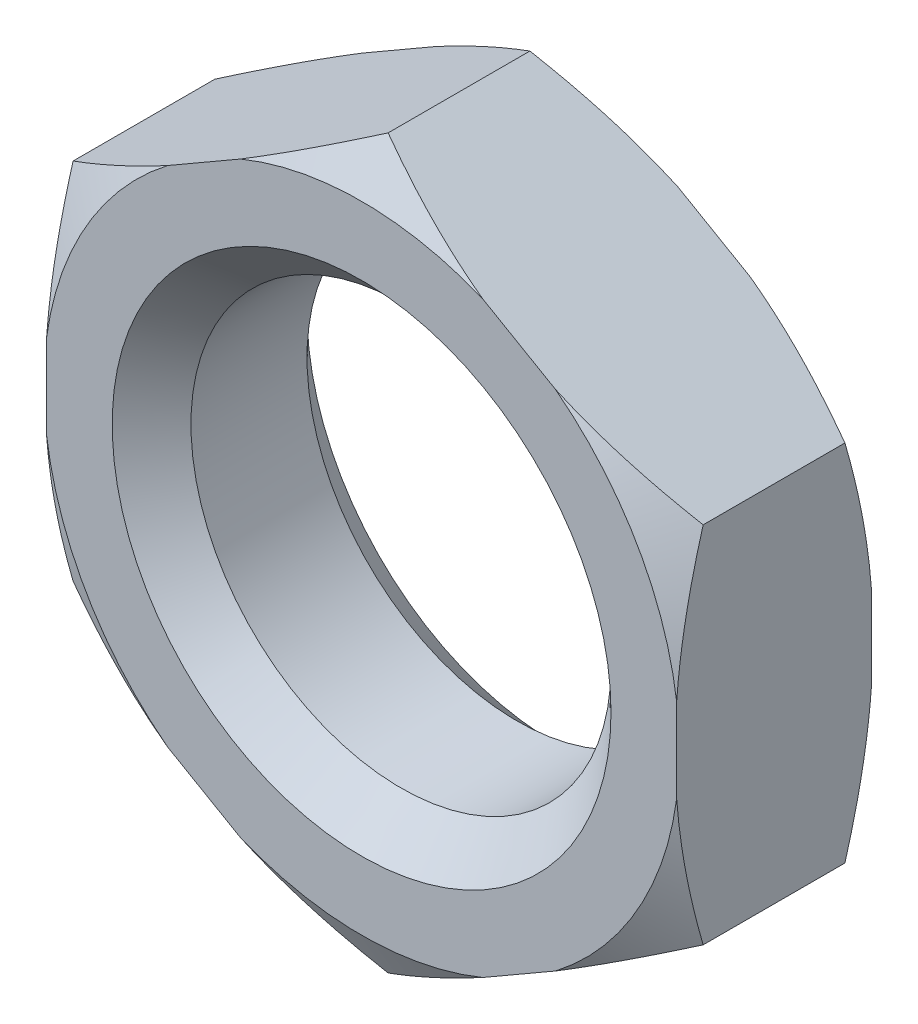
ISO-10303-21;
HEADER;
FILE_DESCRIPTION(('STEP AP214'),'2;1');
FILE_NAME('part.step','',(''),(''),'','','');
FILE_SCHEMA(('AUTOMOTIVE_DESIGN { 1 0 10303 214 1 1 1 1 }'));
ENDSEC;
DATA;
#1=APPLICATION_CONTEXT('core data for automotive mechanical design processes');
#2=APPLICATION_PROTOCOL_DEFINITION('international standard','automotive_design',2000,#1);
#3=PRODUCT_CONTEXT('',#1,'mechanical');
#4=PRODUCT('Part','Part','',(#3));
#5=PRODUCT_RELATED_PRODUCT_CATEGORY('part','',(#4));
#6=PRODUCT_DEFINITION_FORMATION('','',#4);
#7=PRODUCT_DEFINITION_CONTEXT('part definition',#1,'design');
#8=PRODUCT_DEFINITION('design','',#6,#7);
#9=PRODUCT_DEFINITION_SHAPE('','',#8);
#10=(LENGTH_UNIT() NAMED_UNIT(*) SI_UNIT(.MILLI.,.METRE.));
#11=(NAMED_UNIT(*) PLANE_ANGLE_UNIT() SI_UNIT($,.RADIAN.));
#12=(NAMED_UNIT(*) SI_UNIT($,.STERADIAN.) SOLID_ANGLE_UNIT());
#13=UNCERTAINTY_MEASURE_WITH_UNIT(LENGTH_MEASURE(1.E-05),#10,'distance_accuracy_value','');
#14=(GEOMETRIC_REPRESENTATION_CONTEXT(3) GLOBAL_UNCERTAINTY_ASSIGNED_CONTEXT((#13)) GLOBAL_UNIT_ASSIGNED_CONTEXT((#10,
#11,#12)) REPRESENTATION_CONTEXT('',''));
#15=CARTESIAN_POINT('',(0.,0.,0.));
#16=DIRECTION('',(0.,0.,1.));
#17=DIRECTION('',(1.,0.,0.));
#18=AXIS2_PLACEMENT_3D('',#15,#16,#17);
#19=CARTESIAN_POINT('',(12.,6.92820323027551,3.71));
#20=DIRECTION('',(-0.5,-0.866025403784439,0.));
#21=DIRECTION('',(0.866025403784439,-0.5,0.));
#22=AXIS2_PLACEMENT_3D('',#19,#20,#21);
#23=PLANE('',#22);
#24=CARTESIAN_POINT('',(-8.33611626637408,18.6692654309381,1.10477325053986));
#25=CARTESIAN_POINT('',(-7.95906383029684,18.4515741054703,0.901297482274));
#26=CARTESIAN_POINT('',(-7.5811095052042,18.2333620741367,0.700015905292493));
#27=CARTESIAN_POINT('',(-6.82301676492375,17.7956770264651,0.302871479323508));
#28=CARTESIAN_POINT('',(-6.44287808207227,17.5762038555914,0.107009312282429));
#29=CARTESIAN_POINT('',(-5.67890758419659,17.1351252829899,-0.278832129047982));
#30=CARTESIAN_POINT('',(-5.29506783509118,16.9135153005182,-0.468790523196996));
#31=CARTESIAN_POINT('',(-4.52451367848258,16.4686356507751,-0.840749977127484));
#32=CARTESIAN_POINT('',(-4.13779936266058,16.2453660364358,-1.02275128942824));
#33=CARTESIAN_POINT('',(-3.3511489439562,15.7911932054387,-1.38156375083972));
#34=CARTESIAN_POINT('',(-2.95112688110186,15.5602403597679,-1.55812479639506));
#35=CARTESIAN_POINT('',(-2.14704869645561,15.0960056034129,-1.89867813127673));
#36=CARTESIAN_POINT('',(-1.7429923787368,14.8627235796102,-2.06266980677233));
#37=CARTESIAN_POINT('',(-0.930751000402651,14.393775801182,-2.37496459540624));
#38=CARTESIAN_POINT('',(-0.522570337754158,14.1581125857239,-2.5232828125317));
#39=CARTESIAN_POINT('',(0.298583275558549,13.6840193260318,-2.80080872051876));
#40=CARTESIAN_POINT('',(0.711555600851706,13.4455896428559,-2.93001887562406));
#41=CARTESIAN_POINT('',(1.69912405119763,12.8754167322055,-3.20949984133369));
#42=CARTESIAN_POINT('',(2.27602044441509,12.5423454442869,-3.34937837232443));
#43=CARTESIAN_POINT('',(3.14726656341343,12.0393312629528,-3.51753906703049));
#44=CARTESIAN_POINT('',(3.4386514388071,11.8711001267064,-3.56664842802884));
#45=CARTESIAN_POINT('',(4.02305719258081,11.5336933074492,-3.64975507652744));
#46=CARTESIAN_POINT('',(4.31607805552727,11.3645176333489,-3.68375250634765));
#47=CARTESIAN_POINT('',(4.89978169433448,11.0275161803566,-3.73535424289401));
#48=CARTESIAN_POINT('',(5.19045208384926,10.8596975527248,-3.75314441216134));
#49=CARTESIAN_POINT('',(5.77219928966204,10.5238256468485,-3.77247608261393));
#50=CARTESIAN_POINT('',(6.06327610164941,10.3557723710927,-3.77401775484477));
#51=CARTESIAN_POINT('',(6.64514868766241,10.019828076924,-3.76080350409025));
#52=CARTESIAN_POINT('',(6.93594446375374,9.8519370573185,-3.74604770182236));
#53=CARTESIAN_POINT('',(7.51663794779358,9.51667351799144,-3.70068520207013));
#54=CARTESIAN_POINT('',(7.80653550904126,9.34930108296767,-3.67007603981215));
#55=CARTESIAN_POINT('',(8.49115690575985,8.95403473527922,-3.57984599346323));
#56=CARTESIAN_POINT('',(8.88524036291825,8.72651054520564,-3.51369656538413));
#57=CARTESIAN_POINT('',(9.66964112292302,8.27363655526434,-3.35642715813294));
#58=CARTESIAN_POINT('',(10.0599578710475,8.04828707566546,-3.26530355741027));
#59=CARTESIAN_POINT('',(10.8367752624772,7.59979134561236,-3.06152529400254));
#60=CARTESIAN_POINT('',(11.2232710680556,7.37664788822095,-2.94884629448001));
#61=CARTESIAN_POINT('',(11.9919262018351,6.93286463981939,-2.70550759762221));
#62=CARTESIAN_POINT('',(12.3740858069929,6.71222468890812,-2.57484905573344));
#63=CARTESIAN_POINT('',(13.1388652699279,6.27067906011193,-2.29700896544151));
#64=CARTESIAN_POINT('',(13.5214360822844,6.04980169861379,-2.14964866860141));
#65=CARTESIAN_POINT('',(14.2825244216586,5.61038714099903,-1.84253657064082));
#66=CARTESIAN_POINT('',(14.6610444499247,5.3918485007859,-1.6827929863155));
#67=CARTESIAN_POINT('',(15.414612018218,4.95677606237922,-1.35311952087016));
#68=CARTESIAN_POINT('',(15.7896604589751,4.74024174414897,-1.18319237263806));
#69=CARTESIAN_POINT('',(16.5368587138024,4.30884663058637,-0.834906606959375));
#70=CARTESIAN_POINT('',(16.9090081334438,4.09398606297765,-0.656546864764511));
#71=CARTESIAN_POINT('',(17.5380979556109,3.73078088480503,-0.348101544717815));
#72=CARTESIAN_POINT('',(17.795699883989,3.58205434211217,-0.219807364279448));
#73=CARTESIAN_POINT('',(18.3097706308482,3.2852554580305,0.039745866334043));
#74=CARTESIAN_POINT('',(18.5662394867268,3.13718309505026,0.171004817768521));
#75=CARTESIAN_POINT('',(19.0754509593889,2.84318971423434,0.434733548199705));
#76=CARTESIAN_POINT('',(19.3282042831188,2.69726251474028,0.567175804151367));
#77=CARTESIAN_POINT('',(19.8328122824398,2.40592695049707,0.834337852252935));
#78=CARTESIAN_POINT('',(20.084666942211,2.26051859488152,0.969057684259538));
#79=CARTESIAN_POINT('',(20.3361162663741,2.11534425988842,1.10477325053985));
#80=B_SPLINE_CURVE_WITH_KNOTS('',3,(#24,#25,#26,#27,#28,#29,#30,#31,#32,#33,#34,#35,#36,#37,#38,
#39,#40,#41,#42,#43,#44,#45,#46,#47,#48,#49,#50,#51,#52,#53,#54,#55,#56,#57,#58,#59,#60,#61,#62,
#63,#64,#65,#66,#67,#68,#69,#70,#71,#72,#73,#74,#75,#76,#77,#78,#79),.UNSPECIFIED.,.F.,.F.,(4,2,
2,2,2,2,2,2,2,2,2,2,2,2,2,2,2,2,2,2,2,2,2,2,2,2,2,4),(0.,1.4417657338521,2.88371207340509,
4.33028259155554,5.77680716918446,7.26015892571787,8.74358307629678,10.2255644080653,
11.7073544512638,13.7471508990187,14.7669515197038,15.7867425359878,16.7946858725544,
17.8026185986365,18.8105438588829,19.8186258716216,21.1972856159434,22.5761453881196,
23.9565712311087,25.3369084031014,26.7337361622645,28.1296448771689,29.5251806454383,
30.9209030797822,31.8927101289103,32.8644848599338,33.8259733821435,34.7874787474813),.UNSPECIFIED.);
#81=CARTESIAN_POINT('',(0.,13.856406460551,-2.69963702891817));
#82=VERTEX_POINT('',#81);
#83=CARTESIAN_POINT('',(4.61298592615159,11.1930977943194,-3.71));
#84=VERTEX_POINT('',#83);
#85=EDGE_CURVE('E177',#82,#84,#80,.T.);
#86=ORIENTED_EDGE('',*,*,#85,.F.);
#87=DIRECTION('',(0.,0.,-1.));
#88=VECTOR('',#87,1.);
#89=CARTESIAN_POINT('',(0.,13.856406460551,3.71));
#90=LINE('',#89,#88);
#91=CARTESIAN_POINT('',(0.,13.856406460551,2.69963702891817));
#92=VERTEX_POINT('',#91);
#93=EDGE_CURVE('E223',#92,#82,#90,.T.);
#94=ORIENTED_EDGE('',*,*,#93,.F.);
#95=CARTESIAN_POINT('',(20.3361162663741,2.11534425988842,-1.10477325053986));
#96=CARTESIAN_POINT('',(19.9590638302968,2.33303558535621,-0.901297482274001));
#97=CARTESIAN_POINT('',(19.5811095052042,2.55124761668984,-0.700015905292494));
#98=CARTESIAN_POINT('',(18.8230167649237,2.98893266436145,-0.302871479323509));
#99=CARTESIAN_POINT('',(18.4428780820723,3.20840583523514,-0.107009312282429));
#100=CARTESIAN_POINT('',(17.6789075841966,3.6494844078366,0.278832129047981));
#101=CARTESIAN_POINT('',(17.2950678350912,3.87109439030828,0.468790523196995));
#102=CARTESIAN_POINT('',(16.5245136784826,4.31597404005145,0.840749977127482));
#103=CARTESIAN_POINT('',(16.1377993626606,4.53924365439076,1.02275128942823));
#104=CARTESIAN_POINT('',(15.3511489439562,4.99341648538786,1.38156375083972));
#105=CARTESIAN_POINT('',(14.9511268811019,5.22436933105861,1.55812479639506));
#106=CARTESIAN_POINT('',(14.1470486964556,5.68860408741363,1.89867813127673));
#107=CARTESIAN_POINT('',(13.7429923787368,5.92188611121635,2.06266980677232));
#108=CARTESIAN_POINT('',(12.9307510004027,6.39083388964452,2.37496459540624));
#109=CARTESIAN_POINT('',(12.5225703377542,6.62649710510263,2.52328281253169));
#110=CARTESIAN_POINT('',(11.7014167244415,7.10059036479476,2.80080872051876));
#111=CARTESIAN_POINT('',(11.2884443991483,7.33902004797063,2.93001887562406));
#112=CARTESIAN_POINT('',(10.3008759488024,7.90919295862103,3.20949984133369));
#113=CARTESIAN_POINT('',(9.72397955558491,8.24226424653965,3.34937837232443));
#114=CARTESIAN_POINT('',(8.85273343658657,8.74527842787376,3.51753906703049));
#115=CARTESIAN_POINT('',(8.56134856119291,8.91350956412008,3.56664842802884));
#116=CARTESIAN_POINT('',(7.97694280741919,9.2509163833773,3.64975507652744));
#117=CARTESIAN_POINT('',(7.68392194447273,9.42009205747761,3.68375250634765));
#118=CARTESIAN_POINT('',(7.10021830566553,9.75709351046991,3.73535424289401));
#119=CARTESIAN_POINT('',(6.80954791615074,9.92491213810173,3.75314441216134));
#120=CARTESIAN_POINT('',(6.22780071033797,10.260784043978,3.77247608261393));
#121=CARTESIAN_POINT('',(5.93672389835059,10.4288373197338,3.77401775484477));
#122=CARTESIAN_POINT('',(5.3548513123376,10.7647816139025,3.76080350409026));
#123=CARTESIAN_POINT('',(5.06405553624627,10.932672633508,3.74604770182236));
#124=CARTESIAN_POINT('',(4.48336205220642,11.2679361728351,3.70068520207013));
#125=CARTESIAN_POINT('',(4.19346449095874,11.4353086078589,3.67007603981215));
#126=CARTESIAN_POINT('',(3.50884309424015,11.8305749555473,3.57984599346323));
#127=CARTESIAN_POINT('',(3.11475963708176,12.0580991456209,3.51369656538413));
#128=CARTESIAN_POINT('',(2.33035887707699,12.5109731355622,3.35642715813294));
#129=CARTESIAN_POINT('',(1.94004212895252,12.7363226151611,3.26530355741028));
#130=CARTESIAN_POINT('',(1.16322473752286,13.1848183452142,3.06152529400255));
#131=CARTESIAN_POINT('',(0.776728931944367,13.4079618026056,2.94884629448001));
#132=CARTESIAN_POINT('',(0.00807379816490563,13.8517450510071,2.70550759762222));
#133=CARTESIAN_POINT('',(-0.374085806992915,14.0723850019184,2.57484905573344));
#134=CARTESIAN_POINT('',(-1.13886526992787,14.5139306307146,2.29700896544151));
#135=CARTESIAN_POINT('',(-1.52143608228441,14.7348079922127,2.14964866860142));
#136=CARTESIAN_POINT('',(-2.28252442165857,15.1742225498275,1.84253657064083));
#137=CARTESIAN_POINT('',(-2.66104444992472,15.3927611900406,1.68279298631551));
#138=CARTESIAN_POINT('',(-3.41461201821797,15.8278336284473,1.35311952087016));
#139=CARTESIAN_POINT('',(-3.78966045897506,16.0443679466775,1.18319237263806));
#140=CARTESIAN_POINT('',(-4.53685871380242,16.4757630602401,0.834906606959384));
#141=CARTESIAN_POINT('',(-4.90900813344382,16.6906236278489,0.656546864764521));
#142=CARTESIAN_POINT('',(-5.53809795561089,17.0538288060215,0.348101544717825));
#143=CARTESIAN_POINT('',(-5.79569988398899,17.2025553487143,0.219807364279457));
#144=CARTESIAN_POINT('',(-6.3097706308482,17.499354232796,-0.0397458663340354));
#145=CARTESIAN_POINT('',(-6.56623948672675,17.6474265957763,-0.171004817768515));
#146=CARTESIAN_POINT('',(-7.07545095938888,17.9414199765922,-0.4347335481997));
#147=CARTESIAN_POINT('',(-7.32820428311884,18.0873471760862,-0.567175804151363));
#148=CARTESIAN_POINT('',(-7.83281228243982,18.3786827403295,-0.834337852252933));
#149=CARTESIAN_POINT('',(-8.08466694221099,18.524091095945,-0.969057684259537));
#150=CARTESIAN_POINT('',(-8.33611626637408,18.6692654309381,-1.10477325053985));
#151=B_SPLINE_CURVE_WITH_KNOTS('',3,(#95,#96,#97,#98,#99,#100,#101,#102,#103,#104,#105,#106,
#107,#108,#109,#110,#111,#112,#113,#114,#115,#116,#117,#118,#119,#120,#121,#122,#123,#124,#125,
#126,#127,#128,#129,#130,#131,#132,#133,#134,#135,#136,#137,#138,#139,#140,#141,#142,#143,#144,
#145,#146,#147,#148,#149,#150),.UNSPECIFIED.,.F.,.F.,(4,2,2,2,2,2,2,2,2,2,2,2,2,2,2,2,2,2,2,2,2,
2,2,2,2,2,2,4),(0.,1.4417657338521,2.88371207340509,4.33028259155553,5.77680716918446,
7.26015892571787,8.74358307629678,10.2255644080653,11.7073544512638,13.7471508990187,
14.7669515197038,15.7867425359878,16.7946858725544,17.8026185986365,18.8105438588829,
19.8186258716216,21.1972856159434,22.5761453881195,23.9565712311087,25.3369084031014,
26.7337361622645,28.1296448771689,29.5251806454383,30.9209030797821,31.8927101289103,
32.8644848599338,33.8259733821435,34.7874787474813),.UNSPECIFIED.);
#152=CARTESIAN_POINT('',(4.61298592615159,11.1930977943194,3.71));
#153=VERTEX_POINT('',#152);
#154=EDGE_CURVE('E374',#153,#92,#151,.T.);
#155=ORIENTED_EDGE('',*,*,#154,.F.);
#156=DIRECTION('',(-0.866025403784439,0.5,0.));
#157=VECTOR('',#156,1.);
#158=CARTESIAN_POINT('',(12.,6.92820323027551,3.71));
#159=LINE('',#158,#157);
#160=CARTESIAN_POINT('',(7.3870140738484,9.59151189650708,3.71));
#161=VERTEX_POINT('',#160);
#162=EDGE_CURVE('E352',#161,#153,#159,.T.);
#163=ORIENTED_EDGE('',*,*,#162,.F.);
#164=CARTESIAN_POINT('',(12.,6.9282032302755,2.69963702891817));
#165=VERTEX_POINT('',#164);
#166=EDGE_CURVE('E194',#165,#161,#151,.T.);
#167=ORIENTED_EDGE('',*,*,#166,.F.);
#168=DIRECTION('',(0.,0.,-1.));
#169=VECTOR('',#168,1.);
#170=CARTESIAN_POINT('',(12.,6.92820323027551,3.71));
#171=LINE('',#170,#169);
#172=CARTESIAN_POINT('',(12.,6.9282032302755,-2.69963702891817));
#173=VERTEX_POINT('',#172);
#174=EDGE_CURVE('E183',#165,#173,#171,.T.);
#175=ORIENTED_EDGE('',*,*,#174,.T.);
#176=CARTESIAN_POINT('',(7.3870140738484,9.59151189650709,-3.71));
#177=VERTEX_POINT('',#176);
#178=EDGE_CURVE('E164',#177,#173,#80,.T.);
#179=ORIENTED_EDGE('',*,*,#178,.F.);
#180=DIRECTION('',(-0.866025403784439,0.5,0.));
#181=VECTOR('',#180,1.);
#182=CARTESIAN_POINT('',(12.,6.92820323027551,-3.71));
#183=LINE('',#182,#181);
#184=EDGE_CURVE('E264',#177,#84,#183,.T.);
#185=ORIENTED_EDGE('',*,*,#184,.T.);
#186=EDGE_LOOP('',(#86,#94,#155,#163,#167,#175,#179,#185));
#187=FACE_BOUND('',#186,.T.);
#188=ADVANCED_FACE('F39',(#187),#23,.F.);
#189=CARTESIAN_POINT('',(0.,13.856406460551,3.71));
#190=DIRECTION('',(0.5,-0.866025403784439,0.));
#191=DIRECTION('',(0.866025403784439,0.5,0.));
#192=AXIS2_PLACEMENT_3D('',#189,#190,#191);
#193=PLANE('',#192);
#194=CARTESIAN_POINT('',(-20.3361162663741,2.11534425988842,1.10477325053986));
#195=CARTESIAN_POINT('',(-19.9590638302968,2.33303558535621,0.901297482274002));
#196=CARTESIAN_POINT('',(-19.5811095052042,2.55124761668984,0.700015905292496));
#197=CARTESIAN_POINT('',(-18.8230167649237,2.98893266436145,0.302871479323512));
#198=CARTESIAN_POINT('',(-18.4428780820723,3.20840583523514,0.107009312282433));
#199=CARTESIAN_POINT('',(-17.6789075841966,3.6494844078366,-0.278832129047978));
#200=CARTESIAN_POINT('',(-17.2950678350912,3.87109439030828,-0.468790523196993));
#201=CARTESIAN_POINT('',(-16.5245136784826,4.31597404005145,-0.840749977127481));
#202=CARTESIAN_POINT('',(-16.1377993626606,4.53924365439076,-1.02275128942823));
#203=CARTESIAN_POINT('',(-15.3511489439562,4.99341648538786,-1.38156375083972));
#204=CARTESIAN_POINT('',(-14.9511268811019,5.22436933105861,-1.55812479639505));
#205=CARTESIAN_POINT('',(-14.1470486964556,5.68860408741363,-1.89867813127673));
#206=CARTESIAN_POINT('',(-13.7429923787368,5.92188611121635,-2.06266980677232));
#207=CARTESIAN_POINT('',(-12.9307510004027,6.39083388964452,-2.37496459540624));
#208=CARTESIAN_POINT('',(-12.5225703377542,6.62649710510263,-2.52328281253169));
#209=CARTESIAN_POINT('',(-11.7014167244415,7.10059036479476,-2.80080872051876));
#210=CARTESIAN_POINT('',(-11.2884443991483,7.33902004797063,-2.93001887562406));
#211=CARTESIAN_POINT('',(-10.3008759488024,7.90919295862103,-3.20949984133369));
#212=CARTESIAN_POINT('',(-9.72397955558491,8.24226424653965,-3.34937837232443));
#213=CARTESIAN_POINT('',(-8.85273343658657,8.74527842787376,-3.51753906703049));
#214=CARTESIAN_POINT('',(-8.56134856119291,8.91350956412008,-3.56664842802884));
#215=CARTESIAN_POINT('',(-7.97694280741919,9.2509163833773,-3.64975507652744));
#216=CARTESIAN_POINT('',(-7.68392194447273,9.42009205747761,-3.68375250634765));
#217=CARTESIAN_POINT('',(-7.10021830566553,9.75709351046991,-3.73535424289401));
#218=CARTESIAN_POINT('',(-6.80954791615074,9.92491213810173,-3.75314441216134));
#219=CARTESIAN_POINT('',(-6.22780071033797,10.260784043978,-3.77247608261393));
#220=CARTESIAN_POINT('',(-5.93672389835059,10.4288373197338,-3.77401775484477));
#221=CARTESIAN_POINT('',(-5.35485131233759,10.7647816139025,-3.76080350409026));
#222=CARTESIAN_POINT('',(-5.06405553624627,10.932672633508,-3.74604770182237));
#223=CARTESIAN_POINT('',(-4.48336205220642,11.2679361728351,-3.70068520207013));
#224=CARTESIAN_POINT('',(-4.19346449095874,11.4353086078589,-3.67007603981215));
#225=CARTESIAN_POINT('',(-3.50884309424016,11.8305749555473,-3.57984599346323));
#226=CARTESIAN_POINT('',(-3.11475963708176,12.0580991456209,-3.51369656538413));
#227=CARTESIAN_POINT('',(-2.33035887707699,12.5109731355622,-3.35642715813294));
#228=CARTESIAN_POINT('',(-1.94004212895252,12.7363226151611,-3.26530355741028));
#229=CARTESIAN_POINT('',(-1.16322473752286,13.1848183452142,-3.06152529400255));
#230=CARTESIAN_POINT('',(-0.776728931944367,13.4079618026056,-2.94884629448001));
#231=CARTESIAN_POINT('',(-0.00807379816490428,13.8517450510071,-2.70550759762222));
#232=CARTESIAN_POINT('',(0.374085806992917,14.0723850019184,-2.57484905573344));
#233=CARTESIAN_POINT('',(1.13886526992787,14.5139306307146,-2.29700896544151));
#234=CARTESIAN_POINT('',(1.52143608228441,14.7348079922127,-2.14964866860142));
#235=CARTESIAN_POINT('',(2.28252442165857,15.1742225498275,-1.84253657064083));
#236=CARTESIAN_POINT('',(2.66104444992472,15.3927611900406,-1.68279298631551));
#237=CARTESIAN_POINT('',(3.41461201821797,15.8278336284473,-1.35311952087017));
#238=CARTESIAN_POINT('',(3.78966045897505,16.0443679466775,-1.18319237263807));
#239=CARTESIAN_POINT('',(4.53685871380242,16.4757630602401,-0.834906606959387));
#240=CARTESIAN_POINT('',(4.90900813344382,16.6906236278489,-0.656546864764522));
#241=CARTESIAN_POINT('',(5.5380979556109,17.0538288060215,-0.348101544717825));
#242=CARTESIAN_POINT('',(5.79569988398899,17.2025553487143,-0.219807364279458));
#243=CARTESIAN_POINT('',(6.3097706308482,17.499354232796,0.0397458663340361));
#244=CARTESIAN_POINT('',(6.56623948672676,17.6474265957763,0.171004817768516));
#245=CARTESIAN_POINT('',(7.07545095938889,17.9414199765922,0.434733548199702));
#246=CARTESIAN_POINT('',(7.32820428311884,18.0873471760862,0.567175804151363));
#247=CARTESIAN_POINT('',(7.83281228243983,18.3786827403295,0.834337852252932));
#248=CARTESIAN_POINT('',(8.084666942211,18.524091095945,0.969057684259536));
#249=CARTESIAN_POINT('',(8.33611626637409,18.6692654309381,1.10477325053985));
#250=B_SPLINE_CURVE_WITH_KNOTS('',3,(#194,#195,#196,#197,#198,#199,#200,#201,#202,#203,#204,
#205,#206,#207,#208,#209,#210,#211,#212,#213,#214,#215,#216,#217,#218,#219,#220,#221,#222,#223,
#224,#225,#226,#227,#228,#229,#230,#231,#232,#233,#234,#235,#236,#237,#238,#239,#240,#241,#242,
#243,#244,#245,#246,#247,#248,#249),.UNSPECIFIED.,.F.,.F.,(4,2,2,2,2,2,2,2,2,2,2,2,2,2,2,2,2,2,
2,2,2,2,2,2,2,2,2,4),(0.,1.4417657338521,2.88371207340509,4.33028259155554,5.77680716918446,
7.26015892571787,8.74358307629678,10.2255644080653,11.7073544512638,13.7471508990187,
14.7669515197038,15.7867425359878,16.7946858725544,17.8026185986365,18.8105438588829,
19.8186258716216,21.1972856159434,22.5761453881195,23.9565712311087,25.3369084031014,
26.7337361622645,28.1296448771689,29.5251806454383,30.9209030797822,31.8927101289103,
32.8644848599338,33.8259733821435,34.7874787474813),.UNSPECIFIED.);
#251=CARTESIAN_POINT('',(-12.,6.9282032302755,-2.69963702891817));
#252=VERTEX_POINT('',#251);
#253=CARTESIAN_POINT('',(-7.38701407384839,9.59151189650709,-3.71));
#254=VERTEX_POINT('',#253);
#255=EDGE_CURVE('E55',#252,#254,#250,.T.);
#256=ORIENTED_EDGE('',*,*,#255,.F.);
#257=DIRECTION('',(0.,0.,-1.));
#258=VECTOR('',#257,1.);
#259=CARTESIAN_POINT('',(-12.,6.92820323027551,3.71));
#260=LINE('',#259,#258);
#261=CARTESIAN_POINT('',(-12.,6.9282032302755,2.69963702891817));
#262=VERTEX_POINT('',#261);
#263=EDGE_CURVE('E219',#262,#252,#260,.T.);
#264=ORIENTED_EDGE('',*,*,#263,.F.);
#265=CARTESIAN_POINT('',(8.33611626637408,18.6692654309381,-1.10477325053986));
#266=CARTESIAN_POINT('',(7.95906383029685,18.4515741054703,-0.901297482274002));
#267=CARTESIAN_POINT('',(7.5811095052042,18.2333620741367,-0.700015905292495));
#268=CARTESIAN_POINT('',(6.82301676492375,17.7956770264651,-0.302871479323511));
#269=CARTESIAN_POINT('',(6.44287808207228,17.5762038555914,-0.107009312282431));
#270=CARTESIAN_POINT('',(5.6789075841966,17.1351252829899,0.278832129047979));
#271=CARTESIAN_POINT('',(5.2950678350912,16.9135153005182,0.468790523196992));
#272=CARTESIAN_POINT('',(4.52451367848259,16.4686356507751,0.840749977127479));
#273=CARTESIAN_POINT('',(4.13779936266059,16.2453660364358,1.02275128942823));
#274=CARTESIAN_POINT('',(3.35114894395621,15.7911932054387,1.38156375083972));
#275=CARTESIAN_POINT('',(2.95112688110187,15.5602403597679,1.55812479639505));
#276=CARTESIAN_POINT('',(2.14704869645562,15.0960056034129,1.89867813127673));
#277=CARTESIAN_POINT('',(1.74299237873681,14.8627235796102,2.06266980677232));
#278=CARTESIAN_POINT('',(0.930751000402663,14.393775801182,2.37496459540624));
#279=CARTESIAN_POINT('',(0.522570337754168,14.1581125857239,2.52328281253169));
#280=CARTESIAN_POINT('',(-0.29858327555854,13.6840193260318,2.80080872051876));
#281=CARTESIAN_POINT('',(-0.711555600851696,13.4455896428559,2.93001887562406));
#282=CARTESIAN_POINT('',(-1.69912405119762,12.8754167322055,3.20949984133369));
#283=CARTESIAN_POINT('',(-2.27602044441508,12.5423454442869,3.34937837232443));
#284=CARTESIAN_POINT('',(-3.14726656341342,12.0393312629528,3.51753906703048));
#285=CARTESIAN_POINT('',(-3.43865143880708,11.8711001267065,3.56664842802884));
#286=CARTESIAN_POINT('',(-4.0230571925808,11.5336933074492,3.64975507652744));
#287=CARTESIAN_POINT('',(-4.31607805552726,11.3645176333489,3.68375250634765));
#288=CARTESIAN_POINT('',(-4.89978169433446,11.0275161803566,3.73535424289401));
#289=CARTESIAN_POINT('',(-5.19045208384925,10.8596975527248,3.75314441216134));
#290=CARTESIAN_POINT('',(-5.77219928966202,10.5238256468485,3.77247608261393));
#291=CARTESIAN_POINT('',(-6.0632761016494,10.3557723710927,3.77401775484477));
#292=CARTESIAN_POINT('',(-6.6451486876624,10.019828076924,3.76080350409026));
#293=CARTESIAN_POINT('',(-6.93594446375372,9.85193705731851,3.74604770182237));
#294=CARTESIAN_POINT('',(-7.51663794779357,9.51667351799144,3.70068520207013));
#295=CARTESIAN_POINT('',(-7.80653550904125,9.34930108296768,3.67007603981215));
#296=CARTESIAN_POINT('',(-8.49115690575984,8.95403473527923,3.57984599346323));
#297=CARTESIAN_POINT('',(-8.88524036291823,8.72651054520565,3.51369656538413));
#298=CARTESIAN_POINT('',(-9.66964112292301,8.27363655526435,3.35642715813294));
#299=CARTESIAN_POINT('',(-10.0599578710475,8.04828707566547,3.26530355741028));
#300=CARTESIAN_POINT('',(-10.8367752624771,7.59979134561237,3.06152529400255));
#301=CARTESIAN_POINT('',(-11.2232710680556,7.37664788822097,2.94884629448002));
#302=CARTESIAN_POINT('',(-11.9919262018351,6.93286463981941,2.70550759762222));
#303=CARTESIAN_POINT('',(-12.3740858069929,6.71222468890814,2.57484905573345));
#304=CARTESIAN_POINT('',(-13.1388652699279,6.27067906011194,2.29700896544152));
#305=CARTESIAN_POINT('',(-13.5214360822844,6.0498016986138,2.14964866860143));
#306=CARTESIAN_POINT('',(-14.2825244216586,5.61038714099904,1.84253657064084));
#307=CARTESIAN_POINT('',(-14.6610444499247,5.39184850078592,1.68279298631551));
#308=CARTESIAN_POINT('',(-15.414612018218,4.95677606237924,1.35311952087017));
#309=CARTESIAN_POINT('',(-15.789660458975,4.74024174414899,1.18319237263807));
#310=CARTESIAN_POINT('',(-16.5368587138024,4.30884663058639,0.83490660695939));
#311=CARTESIAN_POINT('',(-16.9090081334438,4.09398606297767,0.656546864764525));
#312=CARTESIAN_POINT('',(-17.5380979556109,3.73078088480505,0.348101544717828));
#313=CARTESIAN_POINT('',(-17.795699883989,3.58205434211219,0.21980736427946));
#314=CARTESIAN_POINT('',(-18.3097706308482,3.28525545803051,-0.039745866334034));
#315=CARTESIAN_POINT('',(-18.5662394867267,3.13718309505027,-0.171004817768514));
#316=CARTESIAN_POINT('',(-19.0754509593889,2.84318971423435,-0.4347335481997));
#317=CARTESIAN_POINT('',(-19.3282042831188,2.69726251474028,-0.567175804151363));
#318=CARTESIAN_POINT('',(-19.8328122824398,2.40592695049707,-0.834337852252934));
#319=CARTESIAN_POINT('',(-20.084666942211,2.26051859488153,-0.969057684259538));
#320=CARTESIAN_POINT('',(-20.3361162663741,2.11534425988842,-1.10477325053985));
#321=B_SPLINE_CURVE_WITH_KNOTS('',3,(#265,#266,#267,#268,#269,#270,#271,#272,#273,#274,#275,
#276,#277,#278,#279,#280,#281,#282,#283,#284,#285,#286,#287,#288,#289,#290,#291,#292,#293,#294,
#295,#296,#297,#298,#299,#300,#301,#302,#303,#304,#305,#306,#307,#308,#309,#310,#311,#312,#313,
#314,#315,#316,#317,#318,#319,#320),.UNSPECIFIED.,.F.,.F.,(4,2,2,2,2,2,2,2,2,2,2,2,2,2,2,2,2,2,
2,2,2,2,2,2,2,2,2,4),(0.,1.44176573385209,2.88371207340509,4.33028259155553,5.77680716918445,
7.26015892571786,8.74358307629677,10.2255644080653,11.7073544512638,13.7471508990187,
14.7669515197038,15.7867425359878,16.7946858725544,17.8026185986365,18.8105438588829,
19.8186258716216,21.1972856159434,22.5761453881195,23.9565712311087,25.3369084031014,
26.7337361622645,28.1296448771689,29.5251806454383,30.9209030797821,31.8927101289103,
32.8644848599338,33.8259733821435,34.7874787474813),.UNSPECIFIED.);
#322=CARTESIAN_POINT('',(-7.38701407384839,9.5915118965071,3.71));
#323=VERTEX_POINT('',#322);
#324=EDGE_CURVE('E345',#323,#262,#321,.T.);
#325=ORIENTED_EDGE('',*,*,#324,.F.);
#326=DIRECTION('',(-0.866025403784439,-0.5,0.));
#327=VECTOR('',#326,1.);
#328=CARTESIAN_POINT('',(0.,13.856406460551,3.71));
#329=LINE('',#328,#327);
#330=CARTESIAN_POINT('',(-4.61298592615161,11.1930977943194,3.71));
#331=VERTEX_POINT('',#330);
#332=EDGE_CURVE('E356',#331,#323,#329,.T.);
#333=ORIENTED_EDGE('',*,*,#332,.F.);
#334=EDGE_CURVE('E351',#92,#331,#321,.T.);
#335=ORIENTED_EDGE('',*,*,#334,.F.);
#336=ORIENTED_EDGE('',*,*,#93,.T.);
#337=CARTESIAN_POINT('',(-4.61298592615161,11.1930977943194,-3.71));
#338=VERTEX_POINT('',#337);
#339=EDGE_CURVE('E397',#338,#82,#250,.T.);
#340=ORIENTED_EDGE('',*,*,#339,.F.);
#341=DIRECTION('',(-0.866025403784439,-0.5,0.));
#342=VECTOR('',#341,1.);
#343=CARTESIAN_POINT('',(0.,13.856406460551,-3.71));
#344=LINE('',#343,#342);
#345=EDGE_CURVE('E373',#338,#254,#344,.T.);
#346=ORIENTED_EDGE('',*,*,#345,.T.);
#347=EDGE_LOOP('',(#256,#264,#325,#333,#335,#336,#340,#346));
#348=FACE_BOUND('',#347,.T.);
#349=ADVANCED_FACE('F325',(#348),#193,.F.);
#350=CARTESIAN_POINT('',(-12.,6.92820323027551,3.71));
#351=DIRECTION('',(1.,0.,0.));
#352=DIRECTION('',(0.,0.,-1.));
#353=AXIS2_PLACEMENT_3D('',#350,#351,#352);
#354=PLANE('',#353);
#355=CARTESIAN_POINT('',(-12.,-15.2643194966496,0.510469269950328));
#356=CARTESIAN_POINT('',(-12.,-14.8307695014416,0.313739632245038));
#357=CARTESIAN_POINT('',(-12.,-14.3960340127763,0.11957282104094));
#358=CARTESIAN_POINT('',(-12.,-13.5236842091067,-0.262391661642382));
#359=CARTESIAN_POINT('',(-12.,-13.0860693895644,-0.450188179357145));
#360=CARTESIAN_POINT('',(-12.,-12.2057757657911,-0.81886455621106));
#361=CARTESIAN_POINT('',(-12.,-11.7630834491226,-0.999712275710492));
#362=CARTESIAN_POINT('',(-12.,-10.8739576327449,-1.35194050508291));
#363=CARTESIAN_POINT('',(-12.,-10.4275243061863,-1.5233214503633));
#364=CARTESIAN_POINT('',(-12.,-9.53236451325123,-1.85377035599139));
#365=CARTESIAN_POINT('',(-12.,-9.08365715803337,-2.01288982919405));
#366=CARTESIAN_POINT('',(-12.,-8.1814470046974,-2.31707627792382));
#367=CARTESIAN_POINT('',(-12.,-7.7279439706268,-2.46214255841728));
#368=CARTESIAN_POINT('',(-12.,-6.81635642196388,-2.73490250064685));
#369=CARTESIAN_POINT('',(-12.,-6.35827873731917,-2.8626188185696));
#370=CARTESIAN_POINT('',(-12.,-5.43682219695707,-3.09726399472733));
#371=CARTESIAN_POINT('',(-12.,-4.97344409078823,-3.2041957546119));
#372=CARTESIAN_POINT('',(-12.,-4.17354794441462,-3.36658979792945));
#373=CARTESIAN_POINT('',(-12.,-3.8382477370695,-3.42805336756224));
#374=CARTESIAN_POINT('',(-12.,-3.16535483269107,-3.53688143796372));
#375=CARTESIAN_POINT('',(-12.,-2.82776220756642,-3.58424637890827));
#376=CARTESIAN_POINT('',(-12.,-2.15084908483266,-3.66362527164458));
#377=CARTESIAN_POINT('',(-12.,-1.81152904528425,-3.69564309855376));
#378=CARTESIAN_POINT('',(-12.,-1.13173577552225,-3.74341596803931));
#379=CARTESIAN_POINT('',(-12.,-0.791262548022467,-3.75917104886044));
#380=CARTESIAN_POINT('',(-12.,-0.110125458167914,-3.77392713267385));
#381=CARTESIAN_POINT('',(-12.,0.230538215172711,-3.77293677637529));
#382=CARTESIAN_POINT('',(-12.,0.911400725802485,-3.7542547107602));
#383=CARTESIAN_POINT('',(-12.,1.25159956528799,-3.73656308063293));
#384=CARTESIAN_POINT('',(-12.,1.93079619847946,-3.68501871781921));
#385=CARTESIAN_POINT('',(-12.,2.2697938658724,-3.65116433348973));
#386=CARTESIAN_POINT('',(-12.,2.9459177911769,-3.56826900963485));
#387=CARTESIAN_POINT('',(-12.,3.28304397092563,-3.5192274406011));
#388=CARTESIAN_POINT('',(-12.,4.12312729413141,-3.37917853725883));
#389=CARTESIAN_POINT('',(-12.,4.62463764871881,-3.27945205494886));
#390=CARTESIAN_POINT('',(-12.,5.62164129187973,-3.05345513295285));
#391=CARTESIAN_POINT('',(-12.,6.11713321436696,-2.92717878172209));
#392=CARTESIAN_POINT('',(-12.,7.10308378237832,-2.6525489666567));
#393=CARTESIAN_POINT('',(-12.,7.59352885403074,-2.50414723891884));
#394=CARTESIAN_POINT('',(-12.,8.56863495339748,-2.18968320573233));
#395=CARTESIAN_POINT('',(-12.,9.0532963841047,-2.02362213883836));
#396=CARTESIAN_POINT('',(-12.,10.0230224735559,-1.67531366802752));
#397=CARTESIAN_POINT('',(-12.,10.5080278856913,-1.49290232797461));
#398=CARTESIAN_POINT('',(-12.,11.4735008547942,-1.11641336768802));
#399=CARTESIAN_POINT('',(-12.,11.9539681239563,-0.922335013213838));
#400=CARTESIAN_POINT('',(-12.,12.9080081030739,-0.526017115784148));
#401=CARTESIAN_POINT('',(-12.,13.3816051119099,-0.323835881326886));
#402=CARTESIAN_POINT('',(-12.,14.08946203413,-0.0149260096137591));
#403=CARTESIAN_POINT('',(-12.,14.3249641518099,0.088971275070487));
#404=CARTESIAN_POINT('',(-12.,14.7952005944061,0.298478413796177));
#405=CARTESIAN_POINT('',(-12.,15.0299349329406,0.404088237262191));
#406=CARTESIAN_POINT('',(-12.,15.2643194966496,0.510469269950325));
#407=B_SPLINE_CURVE_WITH_KNOTS('',3,(#355,#356,#357,#358,#359,#360,#361,#362,#363,#364,#365,
#366,#367,#368,#369,#370,#371,#372,#373,#374,#375,#376,#377,#378,#379,#380,#381,#382,#383,#384,
#385,#386,#387,#388,#389,#390,#391,#392,#393,#394,#395,#396,#397,#398,#399,#400,#401,#402,#403,
#404,#405,#406),.UNSPECIFIED.,.F.,.F.,(4,2,2,2,2,2,2,2,2,2,2,2,2,2,2,2,2,2,2,2,2,2,2,2,2,4),(0.,
1.42831270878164,2.85688274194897,4.29141523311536,5.72588169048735,7.15394963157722,
8.58208816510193,10.0083434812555,11.4343995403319,12.4568002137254,13.4791689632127,
14.5012794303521,15.5233874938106,16.5449681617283,17.5665439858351,18.5882242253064,
19.6099468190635,21.1430117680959,22.6764184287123,24.2132203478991,25.7499145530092,
27.3042502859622,28.8586839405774,30.4034435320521,31.1756447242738,31.9478321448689),.UNSPECIFIED.);
#408=CARTESIAN_POINT('',(-12.,-6.92820323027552,-2.69963702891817));
#409=VERTEX_POINT('',#408);
#410=CARTESIAN_POINT('',(-12.,-1.60158589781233,-3.71));
#411=VERTEX_POINT('',#410);
#412=EDGE_CURVE('E63',#409,#411,#407,.T.);
#413=ORIENTED_EDGE('',*,*,#412,.F.);
#414=DIRECTION('',(0.,0.,-1.));
#415=VECTOR('',#414,1.);
#416=CARTESIAN_POINT('',(-12.,-6.92820323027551,3.71));
#417=LINE('',#416,#415);
#418=CARTESIAN_POINT('',(-12.,-6.92820323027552,2.69963702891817));
#419=VERTEX_POINT('',#418);
#420=EDGE_CURVE('E215',#419,#409,#417,.T.);
#421=ORIENTED_EDGE('',*,*,#420,.F.);
#422=CARTESIAN_POINT('',(-12.,15.2643194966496,-0.510469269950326));
#423=CARTESIAN_POINT('',(-12.,14.8307695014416,-0.313739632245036));
#424=CARTESIAN_POINT('',(-12.,14.3960340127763,-0.119572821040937));
#425=CARTESIAN_POINT('',(-12.,13.5236842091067,0.262391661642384));
#426=CARTESIAN_POINT('',(-12.,13.0860693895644,0.450188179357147));
#427=CARTESIAN_POINT('',(-12.,12.2057757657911,0.818864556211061));
#428=CARTESIAN_POINT('',(-12.,11.7630834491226,0.999712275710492));
#429=CARTESIAN_POINT('',(-12.,10.8739576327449,1.35194050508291));
#430=CARTESIAN_POINT('',(-12.,10.4275243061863,1.5233214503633));
#431=CARTESIAN_POINT('',(-12.,9.53236451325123,1.85377035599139));
#432=CARTESIAN_POINT('',(-12.,9.08365715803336,2.01288982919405));
#433=CARTESIAN_POINT('',(-12.,8.1814470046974,2.31707627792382));
#434=CARTESIAN_POINT('',(-12.,7.7279439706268,2.46214255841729));
#435=CARTESIAN_POINT('',(-12.,6.81635642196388,2.73490250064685));
#436=CARTESIAN_POINT('',(-12.,6.35827873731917,2.8626188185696));
#437=CARTESIAN_POINT('',(-12.,5.43682219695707,3.09726399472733));
#438=CARTESIAN_POINT('',(-12.,4.97344409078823,3.2041957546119));
#439=CARTESIAN_POINT('',(-12.,4.17354794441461,3.36658979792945));
#440=CARTESIAN_POINT('',(-12.,3.83824773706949,3.42805336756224));
#441=CARTESIAN_POINT('',(-12.,3.16535483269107,3.53688143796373));
#442=CARTESIAN_POINT('',(-12.,2.82776220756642,3.58424637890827));
#443=CARTESIAN_POINT('',(-12.,2.15084908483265,3.66362527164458));
#444=CARTESIAN_POINT('',(-12.,1.81152904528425,3.69564309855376));
#445=CARTESIAN_POINT('',(-12.,1.13173577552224,3.74341596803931));
#446=CARTESIAN_POINT('',(-12.,0.791262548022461,3.75917104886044));
#447=CARTESIAN_POINT('',(-12.,0.110125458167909,3.77392713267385));
#448=CARTESIAN_POINT('',(-12.,-0.230538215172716,3.77293677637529));
#449=CARTESIAN_POINT('',(-12.,-0.911400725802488,3.7542547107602));
#450=CARTESIAN_POINT('',(-12.,-1.25159956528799,3.73656308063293));
#451=CARTESIAN_POINT('',(-12.,-1.93079619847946,3.68501871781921));
#452=CARTESIAN_POINT('',(-12.,-2.2697938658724,3.65116433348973));
#453=CARTESIAN_POINT('',(-12.,-2.94591779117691,3.56826900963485));
#454=CARTESIAN_POINT('',(-12.,-3.28304397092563,3.5192274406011));
#455=CARTESIAN_POINT('',(-12.,-4.12312729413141,3.37917853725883));
#456=CARTESIAN_POINT('',(-12.,-4.62463764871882,3.27945205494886));
#457=CARTESIAN_POINT('',(-12.,-5.62164129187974,3.05345513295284));
#458=CARTESIAN_POINT('',(-12.,-6.11713321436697,2.92717878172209));
#459=CARTESIAN_POINT('',(-12.,-7.10308378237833,2.6525489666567));
#460=CARTESIAN_POINT('',(-12.,-7.59352885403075,2.50414723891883));
#461=CARTESIAN_POINT('',(-12.,-8.56863495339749,2.18968320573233));
#462=CARTESIAN_POINT('',(-12.,-9.0532963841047,2.02362213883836));
#463=CARTESIAN_POINT('',(-12.,-10.0230224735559,1.67531366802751));
#464=CARTESIAN_POINT('',(-12.,-10.5080278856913,1.4929023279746));
#465=CARTESIAN_POINT('',(-12.,-11.4735008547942,1.11641336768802));
#466=CARTESIAN_POINT('',(-12.,-11.9539681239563,0.922335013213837));
#467=CARTESIAN_POINT('',(-12.,-12.9080081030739,0.526017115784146));
#468=CARTESIAN_POINT('',(-12.,-13.3816051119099,0.323835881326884));
#469=CARTESIAN_POINT('',(-12.,-14.08946203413,0.0149260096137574));
#470=CARTESIAN_POINT('',(-12.,-14.3249641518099,-0.0889712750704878));
#471=CARTESIAN_POINT('',(-12.,-14.7952005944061,-0.298478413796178));
#472=CARTESIAN_POINT('',(-12.,-15.0299349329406,-0.404088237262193));
#473=CARTESIAN_POINT('',(-12.,-15.2643194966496,-0.510469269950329));
#474=B_SPLINE_CURVE_WITH_KNOTS('',3,(#422,#423,#424,#425,#426,#427,#428,#429,#430,#431,#432,
#433,#434,#435,#436,#437,#438,#439,#440,#441,#442,#443,#444,#445,#446,#447,#448,#449,#450,#451,
#452,#453,#454,#455,#456,#457,#458,#459,#460,#461,#462,#463,#464,#465,#466,#467,#468,#469,#470,
#471,#472,#473),.UNSPECIFIED.,.F.,.F.,(4,2,2,2,2,2,2,2,2,2,2,2,2,2,2,2,2,2,2,2,2,2,2,2,2,4),(0.,
1.42831270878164,2.85688274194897,4.29141523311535,5.72588169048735,7.15394963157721,
8.58208816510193,10.0083434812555,11.4343995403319,12.4568002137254,13.4791689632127,
14.5012794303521,15.5233874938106,16.5449681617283,17.5665439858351,18.5882242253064,
19.6099468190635,21.1430117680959,22.6764184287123,24.2132203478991,25.7499145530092,
27.3042502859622,28.8586839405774,30.4034435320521,31.1756447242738,31.9478321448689),.UNSPECIFIED.);
#475=CARTESIAN_POINT('',(-12.,-1.60158589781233,3.71));
#476=VERTEX_POINT('',#475);
#477=EDGE_CURVE('E331',#476,#419,#474,.T.);
#478=ORIENTED_EDGE('',*,*,#477,.F.);
#479=DIRECTION('',(0.,-1.,0.));
#480=VECTOR('',#479,1.);
#481=CARTESIAN_POINT('',(-12.,6.92820323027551,3.71));
#482=LINE('',#481,#480);
#483=CARTESIAN_POINT('',(-12.,1.60158589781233,3.71));
#484=VERTEX_POINT('',#483);
#485=EDGE_CURVE('E360',#484,#476,#482,.T.);
#486=ORIENTED_EDGE('',*,*,#485,.F.);
#487=EDGE_CURVE('E338',#262,#484,#474,.T.);
#488=ORIENTED_EDGE('',*,*,#487,.F.);
#489=ORIENTED_EDGE('',*,*,#263,.T.);
#490=CARTESIAN_POINT('',(-12.,1.60158589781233,-3.71));
#491=VERTEX_POINT('',#490);
#492=EDGE_CURVE('E314',#491,#252,#407,.T.);
#493=ORIENTED_EDGE('',*,*,#492,.F.);
#494=DIRECTION('',(0.,-1.,0.));
#495=VECTOR('',#494,1.);
#496=CARTESIAN_POINT('',(-12.,6.92820323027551,-3.71));
#497=LINE('',#496,#495);
#498=EDGE_CURVE('E378',#491,#411,#497,.T.);
#499=ORIENTED_EDGE('',*,*,#498,.T.);
#500=EDGE_LOOP('',(#413,#421,#478,#486,#488,#489,#493,#499));
#501=FACE_BOUND('',#500,.T.);
#502=ADVANCED_FACE('F321',(#501),#354,.F.);
#503=CARTESIAN_POINT('',(-12.,-6.92820323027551,3.71));
#504=DIRECTION('',(0.5,0.866025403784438,0.));
#505=DIRECTION('',(-0.866025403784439,0.5,0.));
#506=AXIS2_PLACEMENT_3D('',#503,#504,#505);
#507=PLANE('',#506);
#508=CARTESIAN_POINT('',(8.33611626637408,-18.6692654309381,1.10477325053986));
#509=CARTESIAN_POINT('',(7.95906383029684,-18.4515741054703,0.901297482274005));
#510=CARTESIAN_POINT('',(7.58110950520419,-18.2333620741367,0.700015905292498));
#511=CARTESIAN_POINT('',(6.82301676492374,-17.7956770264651,0.302871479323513));
#512=CARTESIAN_POINT('',(6.44287808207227,-17.5762038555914,0.107009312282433));
#513=CARTESIAN_POINT('',(5.67890758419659,-17.1351252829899,-0.278832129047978));
#514=CARTESIAN_POINT('',(5.29506783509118,-16.9135153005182,-0.468790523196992));
#515=CARTESIAN_POINT('',(4.52451367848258,-16.4686356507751,-0.840749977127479));
#516=CARTESIAN_POINT('',(4.13779936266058,-16.2453660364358,-1.02275128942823));
#517=CARTESIAN_POINT('',(3.3511489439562,-15.7911932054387,-1.38156375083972));
#518=CARTESIAN_POINT('',(2.95112688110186,-15.5602403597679,-1.55812479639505));
#519=CARTESIAN_POINT('',(2.14704869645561,-15.0960056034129,-1.89867813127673));
#520=CARTESIAN_POINT('',(1.74299237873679,-14.8627235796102,-2.06266980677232));
#521=CARTESIAN_POINT('',(0.930751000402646,-14.393775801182,-2.37496459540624));
#522=CARTESIAN_POINT('',(0.522570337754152,-14.1581125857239,-2.52328281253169));
#523=CARTESIAN_POINT('',(-0.298583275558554,-13.6840193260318,-2.80080872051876));
#524=CARTESIAN_POINT('',(-0.711555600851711,-13.4455896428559,-2.93001887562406));
#525=CARTESIAN_POINT('',(-1.69912405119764,-12.8754167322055,-3.20949984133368));
#526=CARTESIAN_POINT('',(-2.27602044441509,-12.5423454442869,-3.34937837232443));
#527=CARTESIAN_POINT('',(-3.14726656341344,-12.0393312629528,-3.51753906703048));
#528=CARTESIAN_POINT('',(-3.4386514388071,-11.8711001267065,-3.56664842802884));
#529=CARTESIAN_POINT('',(-4.02305719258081,-11.5336933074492,-3.64975507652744));
#530=CARTESIAN_POINT('',(-4.31607805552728,-11.3645176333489,-3.68375250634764));
#531=CARTESIAN_POINT('',(-4.89978169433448,-11.0275161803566,-3.735354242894));
#532=CARTESIAN_POINT('',(-5.19045208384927,-10.8596975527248,-3.75314441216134));
#533=CARTESIAN_POINT('',(-5.77219928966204,-10.5238256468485,-3.77247608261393));
#534=CARTESIAN_POINT('',(-6.06327610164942,-10.3557723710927,-3.77401775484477));
#535=CARTESIAN_POINT('',(-6.64514868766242,-10.019828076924,-3.76080350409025));
#536=CARTESIAN_POINT('',(-6.93594446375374,-9.85193705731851,-3.74604770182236));
#537=CARTESIAN_POINT('',(-7.51663794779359,-9.51667351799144,-3.70068520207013));
#538=CARTESIAN_POINT('',(-7.80653550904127,-9.34930108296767,-3.67007603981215));
#539=CARTESIAN_POINT('',(-8.49115690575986,-8.95403473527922,-3.57984599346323));
#540=CARTESIAN_POINT('',(-8.88524036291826,-8.72651054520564,-3.51369656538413));
#541=CARTESIAN_POINT('',(-9.66964112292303,-8.27363655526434,-3.35642715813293));
#542=CARTESIAN_POINT('',(-10.0599578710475,-8.04828707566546,-3.26530355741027));
#543=CARTESIAN_POINT('',(-10.8367752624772,-7.59979134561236,-3.06152529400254));
#544=CARTESIAN_POINT('',(-11.2232710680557,-7.37664788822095,-2.94884629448));
#545=CARTESIAN_POINT('',(-11.9919262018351,-6.93286463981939,-2.70550759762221));
#546=CARTESIAN_POINT('',(-12.3740858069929,-6.71222468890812,-2.57484905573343));
#547=CARTESIAN_POINT('',(-13.1388652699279,-6.27067906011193,-2.2970089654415));
#548=CARTESIAN_POINT('',(-13.5214360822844,-6.04980169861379,-2.14964866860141));
#549=CARTESIAN_POINT('',(-14.2825244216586,-5.61038714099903,-1.84253657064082));
#550=CARTESIAN_POINT('',(-14.6610444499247,-5.3918485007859,-1.6827929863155));
#551=CARTESIAN_POINT('',(-15.414612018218,-4.95677606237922,-1.35311952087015));
#552=CARTESIAN_POINT('',(-15.7896604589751,-4.74024174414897,-1.18319237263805));
#553=CARTESIAN_POINT('',(-16.5368587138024,-4.30884663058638,-0.834906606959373));
#554=CARTESIAN_POINT('',(-16.9090081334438,-4.09398606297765,-0.656546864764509));
#555=CARTESIAN_POINT('',(-17.5380979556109,-3.73078088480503,-0.348101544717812));
#556=CARTESIAN_POINT('',(-17.795699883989,-3.58205434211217,-0.219807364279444));
#557=CARTESIAN_POINT('',(-18.3097706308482,-3.2852554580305,0.0397458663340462));
#558=CARTESIAN_POINT('',(-18.5662394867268,-3.13718309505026,0.171004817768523));
#559=CARTESIAN_POINT('',(-19.0754509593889,-2.84318971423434,0.434733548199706));
#560=CARTESIAN_POINT('',(-19.3282042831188,-2.69726251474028,0.567175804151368));
#561=CARTESIAN_POINT('',(-19.8328122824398,-2.40592695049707,0.834337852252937));
#562=CARTESIAN_POINT('',(-20.084666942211,-2.26051859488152,0.96905768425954));
#563=CARTESIAN_POINT('',(-20.3361162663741,-2.11534425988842,1.10477325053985));
#564=B_SPLINE_CURVE_WITH_KNOTS('',3,(#508,#509,#510,#511,#512,#513,#514,#515,#516,#517,#518,
#519,#520,#521,#522,#523,#524,#525,#526,#527,#528,#529,#530,#531,#532,#533,#534,#535,#536,#537,
#538,#539,#540,#541,#542,#543,#544,#545,#546,#547,#548,#549,#550,#551,#552,#553,#554,#555,#556,
#557,#558,#559,#560,#561,#562,#563),.UNSPECIFIED.,.F.,.F.,(4,2,2,2,2,2,2,2,2,2,2,2,2,2,2,2,2,2,
2,2,2,2,2,2,2,2,2,4),(0.,1.4417657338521,2.88371207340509,4.33028259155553,5.77680716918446,
7.26015892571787,8.74358307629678,10.2255644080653,11.7073544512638,13.7471508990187,
14.7669515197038,15.7867425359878,16.7946858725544,17.8026185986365,18.8105438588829,
19.8186258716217,21.1972856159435,22.5761453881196,23.9565712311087,25.3369084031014,
26.7337361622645,28.1296448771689,29.5251806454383,30.9209030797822,31.8927101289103,
32.8644848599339,33.8259733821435,34.7874787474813),.UNSPECIFIED.);
#565=CARTESIAN_POINT('',(0.,-13.856406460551,-2.69963702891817));
#566=VERTEX_POINT('',#565);
#567=CARTESIAN_POINT('',(-4.61298592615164,-11.1930977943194,-3.71));
#568=VERTEX_POINT('',#567);
#569=EDGE_CURVE('E303',#566,#568,#564,.T.);
#570=ORIENTED_EDGE('',*,*,#569,.F.);
#571=DIRECTION('',(0.,0.,-1.));
#572=VECTOR('',#571,1.);
#573=CARTESIAN_POINT('',(0.,-13.856406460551,3.71));
#574=LINE('',#573,#572);
#575=CARTESIAN_POINT('',(0.,-13.856406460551,2.69963702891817));
#576=VERTEX_POINT('',#575);
#577=EDGE_CURVE('E203',#576,#566,#574,.T.);
#578=ORIENTED_EDGE('',*,*,#577,.F.);
#579=CARTESIAN_POINT('',(-20.3361162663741,-2.11534425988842,-1.10477325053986));
#580=CARTESIAN_POINT('',(-19.9590638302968,-2.33303558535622,-0.901297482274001));
#581=CARTESIAN_POINT('',(-19.5811095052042,-2.55124761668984,-0.700015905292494));
#582=CARTESIAN_POINT('',(-18.8230167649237,-2.98893266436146,-0.302871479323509));
#583=CARTESIAN_POINT('',(-18.4428780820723,-3.20840583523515,-0.107009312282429));
#584=CARTESIAN_POINT('',(-17.6789075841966,-3.6494844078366,0.278832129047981));
#585=CARTESIAN_POINT('',(-17.2950678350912,-3.87109439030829,0.468790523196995));
#586=CARTESIAN_POINT('',(-16.5245136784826,-4.31597404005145,0.840749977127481));
#587=CARTESIAN_POINT('',(-16.1377993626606,-4.53924365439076,1.02275128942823));
#588=CARTESIAN_POINT('',(-15.3511489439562,-4.99341648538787,1.38156375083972));
#589=CARTESIAN_POINT('',(-14.9511268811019,-5.22436933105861,1.55812479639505));
#590=CARTESIAN_POINT('',(-14.1470486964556,-5.68860408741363,1.89867813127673));
#591=CARTESIAN_POINT('',(-13.7429923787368,-5.92188611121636,2.06266980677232));
#592=CARTESIAN_POINT('',(-12.9307510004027,-6.39083388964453,2.37496459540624));
#593=CARTESIAN_POINT('',(-12.5225703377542,-6.62649710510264,2.52328281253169));
#594=CARTESIAN_POINT('',(-11.7014167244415,-7.10059036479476,2.80080872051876));
#595=CARTESIAN_POINT('',(-11.2884443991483,-7.33902004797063,2.93001887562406));
#596=CARTESIAN_POINT('',(-10.3008759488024,-7.90919295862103,3.20949984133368));
#597=CARTESIAN_POINT('',(-9.72397955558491,-8.24226424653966,3.34937837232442));
#598=CARTESIAN_POINT('',(-8.85273343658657,-8.74527842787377,3.51753906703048));
#599=CARTESIAN_POINT('',(-8.56134856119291,-8.91350956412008,3.56664842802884));
#600=CARTESIAN_POINT('',(-7.97694280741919,-9.2509163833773,3.64975507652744));
#601=CARTESIAN_POINT('',(-7.68392194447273,-9.42009205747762,3.68375250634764));
#602=CARTESIAN_POINT('',(-7.10021830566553,-9.75709351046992,3.735354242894));
#603=CARTESIAN_POINT('',(-6.80954791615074,-9.92491213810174,3.75314441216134));
#604=CARTESIAN_POINT('',(-6.22780071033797,-10.2607840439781,3.77247608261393));
#605=CARTESIAN_POINT('',(-5.93672389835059,-10.4288373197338,3.77401775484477));
#606=CARTESIAN_POINT('',(-5.35485131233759,-10.7647816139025,3.76080350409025));
#607=CARTESIAN_POINT('',(-5.06405553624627,-10.932672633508,3.74604770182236));
#608=CARTESIAN_POINT('',(-4.48336205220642,-11.2679361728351,3.70068520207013));
#609=CARTESIAN_POINT('',(-4.19346449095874,-11.4353086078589,3.67007603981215));
#610=CARTESIAN_POINT('',(-3.50884309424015,-11.8305749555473,3.57984599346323));
#611=CARTESIAN_POINT('',(-3.11475963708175,-12.0580991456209,3.51369656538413));
#612=CARTESIAN_POINT('',(-2.33035887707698,-12.5109731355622,3.35642715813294));
#613=CARTESIAN_POINT('',(-1.94004212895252,-12.7363226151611,3.26530355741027));
#614=CARTESIAN_POINT('',(-1.16322473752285,-13.1848183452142,3.06152529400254));
#615=CARTESIAN_POINT('',(-0.77672893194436,-13.4079618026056,2.94884629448));
#616=CARTESIAN_POINT('',(-0.00807379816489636,-13.8517450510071,2.70550759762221));
#617=CARTESIAN_POINT('',(0.374085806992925,-14.0723850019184,2.57484905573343));
#618=CARTESIAN_POINT('',(1.13886526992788,-14.5139306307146,2.2970089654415));
#619=CARTESIAN_POINT('',(1.52143608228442,-14.7348079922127,2.14964866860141));
#620=CARTESIAN_POINT('',(2.28252442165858,-15.1742225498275,1.84253657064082));
#621=CARTESIAN_POINT('',(2.66104444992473,-15.3927611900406,1.6827929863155));
#622=CARTESIAN_POINT('',(3.41461201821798,-15.8278336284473,1.35311952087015));
#623=CARTESIAN_POINT('',(3.78966045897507,-16.0443679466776,1.18319237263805));
#624=CARTESIAN_POINT('',(4.53685871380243,-16.4757630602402,0.834906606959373));
#625=CARTESIAN_POINT('',(4.90900813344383,-16.6906236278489,0.656546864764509));
#626=CARTESIAN_POINT('',(5.53809795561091,-17.0538288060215,0.348101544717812));
#627=CARTESIAN_POINT('',(5.795699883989,-17.2025553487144,0.219807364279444));
#628=CARTESIAN_POINT('',(6.3097706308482,-17.499354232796,-0.0397458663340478));
#629=CARTESIAN_POINT('',(6.56623948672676,-17.6474265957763,-0.171004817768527));
#630=CARTESIAN_POINT('',(7.07545095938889,-17.9414199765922,-0.43473354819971));
#631=CARTESIAN_POINT('',(7.32820428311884,-18.0873471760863,-0.567175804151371));
#632=CARTESIAN_POINT('',(7.83281228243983,-18.3786827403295,-0.834337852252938));
#633=CARTESIAN_POINT('',(8.08466694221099,-18.524091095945,-0.96905768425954));
#634=CARTESIAN_POINT('',(8.33611626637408,-18.6692654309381,-1.10477325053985));
#635=B_SPLINE_CURVE_WITH_KNOTS('',3,(#579,#580,#581,#582,#583,#584,#585,#586,#587,#588,#589,
#590,#591,#592,#593,#594,#595,#596,#597,#598,#599,#600,#601,#602,#603,#604,#605,#606,#607,#608,
#609,#610,#611,#612,#613,#614,#615,#616,#617,#618,#619,#620,#621,#622,#623,#624,#625,#626,#627,
#628,#629,#630,#631,#632,#633,#634),.UNSPECIFIED.,.F.,.F.,(4,2,2,2,2,2,2,2,2,2,2,2,2,2,2,2,2,2,
2,2,2,2,2,2,2,2,2,4),(0.,1.4417657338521,2.88371207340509,4.33028259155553,5.77680716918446,
7.26015892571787,8.74358307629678,10.2255644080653,11.7073544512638,13.7471508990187,
14.7669515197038,15.7867425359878,16.7946858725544,17.8026185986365,18.8105438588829,
19.8186258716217,21.1972856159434,22.5761453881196,23.9565712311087,25.3369084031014,
26.7337361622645,28.1296448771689,29.5251806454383,30.9209030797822,31.8927101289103,
32.8644848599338,33.8259733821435,34.7874787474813),.UNSPECIFIED.);
#636=CARTESIAN_POINT('',(-4.61298592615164,-11.1930977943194,3.71));
#637=VERTEX_POINT('',#636);
#638=EDGE_CURVE('E340',#637,#576,#635,.T.);
#639=ORIENTED_EDGE('',*,*,#638,.F.);
#640=DIRECTION('',(0.866025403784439,-0.5,0.));
#641=VECTOR('',#640,1.);
#642=CARTESIAN_POINT('',(-12.,-6.92820323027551,3.71));
#643=LINE('',#642,#641);
#644=CARTESIAN_POINT('',(-7.38701407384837,-9.59151189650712,3.71));
#645=VERTEX_POINT('',#644);
#646=EDGE_CURVE('E364',#645,#637,#643,.T.);
#647=ORIENTED_EDGE('',*,*,#646,.F.);
#648=EDGE_CURVE('E339',#419,#645,#635,.T.);
#649=ORIENTED_EDGE('',*,*,#648,.F.);
#650=ORIENTED_EDGE('',*,*,#420,.T.);
#651=CARTESIAN_POINT('',(-7.38701407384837,-9.59151189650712,-3.71));
#652=VERTEX_POINT('',#651);
#653=EDGE_CURVE('E315',#652,#409,#564,.T.);
#654=ORIENTED_EDGE('',*,*,#653,.F.);
#655=DIRECTION('',(0.866025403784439,-0.5,0.));
#656=VECTOR('',#655,1.);
#657=CARTESIAN_POINT('',(-12.,-6.92820323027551,-3.71));
#658=LINE('',#657,#656);
#659=EDGE_CURVE('E382',#652,#568,#658,.T.);
#660=ORIENTED_EDGE('',*,*,#659,.T.);
#661=EDGE_LOOP('',(#570,#578,#639,#647,#649,#650,#654,#660));
#662=FACE_BOUND('',#661,.T.);
#663=ADVANCED_FACE('F324',(#662),#507,.F.);
#664=CARTESIAN_POINT('',(0.,-13.856406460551,3.71));
#665=DIRECTION('',(-0.5,0.866025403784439,0.));
#666=DIRECTION('',(-0.866025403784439,-0.5,0.));
#667=AXIS2_PLACEMENT_3D('',#664,#665,#666);
#668=PLANE('',#667);
#669=CARTESIAN_POINT('',(20.3361162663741,-2.11534425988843,1.10477325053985));
#670=CARTESIAN_POINT('',(19.9590638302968,-2.33303558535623,0.901297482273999));
#671=CARTESIAN_POINT('',(19.5811095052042,-2.55124761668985,0.700015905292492));
#672=CARTESIAN_POINT('',(18.8230167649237,-2.98893266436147,0.302871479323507));
#673=CARTESIAN_POINT('',(18.4428780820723,-3.20840583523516,0.107009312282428));
#674=CARTESIAN_POINT('',(17.6789075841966,-3.64948440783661,-0.278832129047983));
#675=CARTESIAN_POINT('',(17.2950678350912,-3.8710943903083,-0.468790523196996));
#676=CARTESIAN_POINT('',(16.5245136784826,-4.31597404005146,-0.840749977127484));
#677=CARTESIAN_POINT('',(16.1377993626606,-4.53924365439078,-1.02275128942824));
#678=CARTESIAN_POINT('',(15.3511489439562,-4.99341648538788,-1.38156375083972));
#679=CARTESIAN_POINT('',(14.9511268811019,-5.22436933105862,-1.55812479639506));
#680=CARTESIAN_POINT('',(14.1470486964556,-5.68860408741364,-1.89867813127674));
#681=CARTESIAN_POINT('',(13.7429923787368,-5.92188611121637,-2.06266980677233));
#682=CARTESIAN_POINT('',(12.9307510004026,-6.39083388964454,-2.37496459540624));
#683=CARTESIAN_POINT('',(12.5225703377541,-6.62649710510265,-2.52328281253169));
#684=CARTESIAN_POINT('',(11.7014167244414,-7.10059036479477,-2.80080872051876));
#685=CARTESIAN_POINT('',(11.2884443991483,-7.33902004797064,-2.93001887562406));
#686=CARTESIAN_POINT('',(10.3008759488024,-7.90919295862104,-3.20949984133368));
#687=CARTESIAN_POINT('',(9.7239795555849,-8.24226424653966,-3.34937837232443));
#688=CARTESIAN_POINT('',(8.85273343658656,-8.74527842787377,-3.51753906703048));
#689=CARTESIAN_POINT('',(8.5613485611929,-8.91350956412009,-3.56664842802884));
#690=CARTESIAN_POINT('',(7.97694280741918,-9.25091638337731,-3.64975507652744));
#691=CARTESIAN_POINT('',(7.68392194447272,-9.42009205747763,-3.68375250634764));
#692=CARTESIAN_POINT('',(7.10021830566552,-9.75709351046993,-3.735354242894));
#693=CARTESIAN_POINT('',(6.80954791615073,-9.92491213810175,-3.75314441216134));
#694=CARTESIAN_POINT('',(6.22780071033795,-10.2607840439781,-3.77247608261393));
#695=CARTESIAN_POINT('',(5.93672389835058,-10.4288373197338,-3.77401775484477));
#696=CARTESIAN_POINT('',(5.35485131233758,-10.7647816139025,-3.76080350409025));
#697=CARTESIAN_POINT('',(5.06405553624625,-10.932672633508,-3.74604770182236));
#698=CARTESIAN_POINT('',(4.48336205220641,-11.2679361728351,-3.70068520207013));
#699=CARTESIAN_POINT('',(4.19346449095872,-11.4353086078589,-3.67007603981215));
#700=CARTESIAN_POINT('',(3.50884309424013,-11.8305749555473,-3.57984599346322));
#701=CARTESIAN_POINT('',(3.11475963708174,-12.0580991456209,-3.51369656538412));
#702=CARTESIAN_POINT('',(2.33035887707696,-12.5109731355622,-3.35642715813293));
#703=CARTESIAN_POINT('',(1.9400421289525,-12.7363226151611,-3.26530355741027));
#704=CARTESIAN_POINT('',(1.16322473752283,-13.1848183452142,-3.06152529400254));
#705=CARTESIAN_POINT('',(0.776728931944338,-13.4079618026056,-2.94884629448));
#706=CARTESIAN_POINT('',(0.00807379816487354,-13.8517450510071,-2.70550759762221));
#707=CARTESIAN_POINT('',(-0.374085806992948,-14.0723850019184,-2.57484905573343));
#708=CARTESIAN_POINT('',(-1.13886526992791,-14.5139306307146,-2.2970089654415));
#709=CARTESIAN_POINT('',(-1.52143608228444,-14.7348079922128,-2.1496486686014));
#710=CARTESIAN_POINT('',(-2.28252442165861,-15.1742225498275,-1.84253657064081));
#711=CARTESIAN_POINT('',(-2.66104444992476,-15.3927611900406,-1.68279298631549));
#712=CARTESIAN_POINT('',(-3.41461201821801,-15.8278336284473,-1.35311952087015));
#713=CARTESIAN_POINT('',(-3.7896604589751,-16.0443679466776,-1.18319237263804));
#714=CARTESIAN_POINT('',(-4.53685871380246,-16.4757630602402,-0.834906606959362));
#715=CARTESIAN_POINT('',(-4.90900813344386,-16.6906236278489,-0.656546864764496));
#716=CARTESIAN_POINT('',(-5.53809795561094,-17.0538288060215,-0.348101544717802));
#717=CARTESIAN_POINT('',(-5.79569988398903,-17.2025553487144,-0.219807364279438));
#718=CARTESIAN_POINT('',(-6.30977063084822,-17.499354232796,0.0397458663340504));
#719=CARTESIAN_POINT('',(-6.56623948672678,-17.6474265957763,0.171004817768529));
#720=CARTESIAN_POINT('',(-7.0754509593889,-17.9414199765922,0.43473354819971));
#721=CARTESIAN_POINT('',(-7.32820428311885,-18.0873471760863,0.567175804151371));
#722=CARTESIAN_POINT('',(-7.83281228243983,-18.3786827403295,0.834337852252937));
#723=CARTESIAN_POINT('',(-8.084666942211,-18.524091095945,0.969057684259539));
#724=CARTESIAN_POINT('',(-8.33611626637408,-18.6692654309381,1.10477325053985));
#725=B_SPLINE_CURVE_WITH_KNOTS('',3,(#669,#670,#671,#672,#673,#674,#675,#676,#677,#678,#679,
#680,#681,#682,#683,#684,#685,#686,#687,#688,#689,#690,#691,#692,#693,#694,#695,#696,#697,#698,
#699,#700,#701,#702,#703,#704,#705,#706,#707,#708,#709,#710,#711,#712,#713,#714,#715,#716,#717,
#718,#719,#720,#721,#722,#723,#724),.UNSPECIFIED.,.F.,.F.,(4,2,2,2,2,2,2,2,2,2,2,2,2,2,2,2,2,2,
2,2,2,2,2,2,2,2,2,4),(0.,1.4417657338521,2.88371207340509,4.33028259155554,5.77680716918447,
7.26015892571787,8.74358307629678,10.2255644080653,11.7073544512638,13.7471508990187,
14.7669515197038,15.7867425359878,16.7946858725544,17.8026185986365,18.8105438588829,
19.8186258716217,21.1972856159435,22.5761453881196,23.9565712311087,25.3369084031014,
26.7337361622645,28.1296448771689,29.5251806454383,30.9209030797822,31.8927101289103,
32.8644848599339,33.8259733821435,34.7874787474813),.UNSPECIFIED.);
#726=CARTESIAN_POINT('',(12.,-6.92820323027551,-2.69963702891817));
#727=VERTEX_POINT('',#726);
#728=CARTESIAN_POINT('',(7.38701407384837,-9.59151189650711,-3.71));
#729=VERTEX_POINT('',#728);
#730=EDGE_CURVE('E188',#727,#729,#725,.T.);
#731=ORIENTED_EDGE('',*,*,#730,.F.);
#732=DIRECTION('',(0.,0.,-1.));
#733=VECTOR('',#732,1.);
#734=CARTESIAN_POINT('',(12.,-6.92820323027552,3.71));
#735=LINE('',#734,#733);
#736=CARTESIAN_POINT('',(12.,-6.92820323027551,2.69963702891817));
#737=VERTEX_POINT('',#736);
#738=EDGE_CURVE('E196',#737,#727,#735,.T.);
#739=ORIENTED_EDGE('',*,*,#738,.F.);
#740=CARTESIAN_POINT('',(-8.33611626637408,-18.6692654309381,-1.10477325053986));
#741=CARTESIAN_POINT('',(-7.95906383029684,-18.4515741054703,-0.901297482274));
#742=CARTESIAN_POINT('',(-7.5811095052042,-18.2333620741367,-0.700015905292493));
#743=CARTESIAN_POINT('',(-6.82301676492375,-17.7956770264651,-0.30287147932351));
#744=CARTESIAN_POINT('',(-6.44287808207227,-17.5762038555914,-0.107009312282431));
#745=CARTESIAN_POINT('',(-5.67890758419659,-17.1351252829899,0.278832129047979));
#746=CARTESIAN_POINT('',(-5.29506783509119,-16.9135153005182,0.468790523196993));
#747=CARTESIAN_POINT('',(-4.52451367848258,-16.4686356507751,0.840749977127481));
#748=CARTESIAN_POINT('',(-4.13779936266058,-16.2453660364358,1.02275128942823));
#749=CARTESIAN_POINT('',(-3.3511489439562,-15.7911932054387,1.38156375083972));
#750=CARTESIAN_POINT('',(-2.95112688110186,-15.5602403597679,1.55812479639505));
#751=CARTESIAN_POINT('',(-2.14704869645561,-15.0960056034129,1.89867813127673));
#752=CARTESIAN_POINT('',(-1.7429923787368,-14.8627235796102,2.06266980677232));
#753=CARTESIAN_POINT('',(-0.930751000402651,-14.393775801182,2.37496459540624));
#754=CARTESIAN_POINT('',(-0.522570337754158,-14.1581125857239,2.52328281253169));
#755=CARTESIAN_POINT('',(0.298583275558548,-13.6840193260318,2.80080872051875));
#756=CARTESIAN_POINT('',(0.711555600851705,-13.4455896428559,2.93001887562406));
#757=CARTESIAN_POINT('',(1.69912405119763,-12.8754167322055,3.20949984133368));
#758=CARTESIAN_POINT('',(2.27602044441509,-12.5423454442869,3.34937837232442));
#759=CARTESIAN_POINT('',(3.14726656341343,-12.0393312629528,3.51753906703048));
#760=CARTESIAN_POINT('',(3.43865143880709,-11.8711001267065,3.56664842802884));
#761=CARTESIAN_POINT('',(4.02305719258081,-11.5336933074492,3.64975507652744));
#762=CARTESIAN_POINT('',(4.31607805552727,-11.3645176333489,3.68375250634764));
#763=CARTESIAN_POINT('',(4.89978169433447,-11.0275161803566,3.735354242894));
#764=CARTESIAN_POINT('',(5.19045208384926,-10.8596975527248,3.75314441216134));
#765=CARTESIAN_POINT('',(5.77219928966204,-10.5238256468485,3.77247608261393));
#766=CARTESIAN_POINT('',(6.06327610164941,-10.3557723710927,3.77401775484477));
#767=CARTESIAN_POINT('',(6.64514868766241,-10.019828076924,3.76080350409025));
#768=CARTESIAN_POINT('',(6.93594446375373,-9.85193705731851,3.74604770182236));
#769=CARTESIAN_POINT('',(7.51663794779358,-9.51667351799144,3.70068520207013));
#770=CARTESIAN_POINT('',(7.80653550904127,-9.34930108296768,3.67007603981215));
#771=CARTESIAN_POINT('',(8.49115690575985,-8.95403473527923,3.57984599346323));
#772=CARTESIAN_POINT('',(8.88524036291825,-8.72651054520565,3.51369656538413));
#773=CARTESIAN_POINT('',(9.66964112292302,-8.27363655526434,3.35642715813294));
#774=CARTESIAN_POINT('',(10.0599578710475,-8.04828707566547,3.26530355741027));
#775=CARTESIAN_POINT('',(10.8367752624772,-7.59979134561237,3.06152529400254));
#776=CARTESIAN_POINT('',(11.2232710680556,-7.37664788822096,2.94884629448));
#777=CARTESIAN_POINT('',(11.9919262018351,-6.9328646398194,2.70550759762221));
#778=CARTESIAN_POINT('',(12.3740858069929,-6.71222468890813,2.57484905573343));
#779=CARTESIAN_POINT('',(13.1388652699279,-6.27067906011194,2.2970089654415));
#780=CARTESIAN_POINT('',(13.5214360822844,-6.0498016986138,2.14964866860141));
#781=CARTESIAN_POINT('',(14.2825244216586,-5.61038714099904,1.84253657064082));
#782=CARTESIAN_POINT('',(14.6610444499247,-5.39184850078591,1.6827929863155));
#783=CARTESIAN_POINT('',(15.414612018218,-4.95677606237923,1.35311952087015));
#784=CARTESIAN_POINT('',(15.7896604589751,-4.74024174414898,1.18319237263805));
#785=CARTESIAN_POINT('',(16.5368587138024,-4.30884663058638,0.834906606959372));
#786=CARTESIAN_POINT('',(16.9090081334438,-4.09398606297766,0.656546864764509));
#787=CARTESIAN_POINT('',(17.5380979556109,-3.73078088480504,0.348101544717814));
#788=CARTESIAN_POINT('',(17.795699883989,-3.58205434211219,0.219807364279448));
#789=CARTESIAN_POINT('',(18.3097706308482,-3.28525545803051,-0.0397458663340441));
#790=CARTESIAN_POINT('',(18.5662394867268,-3.13718309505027,-0.171004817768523));
#791=CARTESIAN_POINT('',(19.0754509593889,-2.84318971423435,-0.434733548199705));
#792=CARTESIAN_POINT('',(19.3282042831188,-2.69726251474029,-0.567175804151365));
#793=CARTESIAN_POINT('',(19.8328122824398,-2.40592695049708,-0.834337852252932));
#794=CARTESIAN_POINT('',(20.084666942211,-2.26051859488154,-0.969057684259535));
#795=CARTESIAN_POINT('',(20.3361162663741,-2.11534425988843,-1.10477325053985));
#796=B_SPLINE_CURVE_WITH_KNOTS('',3,(#740,#741,#742,#743,#744,#745,#746,#747,#748,#749,#750,
#751,#752,#753,#754,#755,#756,#757,#758,#759,#760,#761,#762,#763,#764,#765,#766,#767,#768,#769,
#770,#771,#772,#773,#774,#775,#776,#777,#778,#779,#780,#781,#782,#783,#784,#785,#786,#787,#788,
#789,#790,#791,#792,#793,#794,#795),.UNSPECIFIED.,.F.,.F.,(4,2,2,2,2,2,2,2,2,2,2,2,2,2,2,2,2,2,
2,2,2,2,2,2,2,2,2,4),(0.,1.4417657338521,2.88371207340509,4.33028259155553,5.77680716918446,
7.26015892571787,8.74358307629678,10.2255644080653,11.7073544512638,13.7471508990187,
14.7669515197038,15.7867425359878,16.7946858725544,17.8026185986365,18.8105438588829,
19.8186258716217,21.1972856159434,22.5761453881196,23.9565712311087,25.3369084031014,
26.7337361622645,28.1296448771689,29.5251806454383,30.9209030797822,31.8927101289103,
32.8644848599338,33.8259733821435,34.7874787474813),.UNSPECIFIED.);
#797=CARTESIAN_POINT('',(7.38701407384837,-9.59151189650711,3.71));
#798=VERTEX_POINT('',#797);
#799=EDGE_CURVE('E393',#798,#737,#796,.T.);
#800=ORIENTED_EDGE('',*,*,#799,.F.);
#801=DIRECTION('',(0.866025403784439,0.5,0.));
#802=VECTOR('',#801,1.);
#803=CARTESIAN_POINT('',(0.,-13.856406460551,3.71));
#804=LINE('',#803,#802);
#805=CARTESIAN_POINT('',(4.61298592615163,-11.1930977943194,3.71));
#806=VERTEX_POINT('',#805);
#807=EDGE_CURVE('E207',#806,#798,#804,.T.);
#808=ORIENTED_EDGE('',*,*,#807,.F.);
#809=EDGE_CURVE('E395',#576,#806,#796,.T.);
#810=ORIENTED_EDGE('',*,*,#809,.F.);
#811=ORIENTED_EDGE('',*,*,#577,.T.);
#812=CARTESIAN_POINT('',(4.61298592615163,-11.1930977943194,-3.71));
#813=VERTEX_POINT('',#812);
#814=EDGE_CURVE('E175',#813,#566,#725,.T.);
#815=ORIENTED_EDGE('',*,*,#814,.F.);
#816=DIRECTION('',(0.866025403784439,0.5,0.));
#817=VECTOR('',#816,1.);
#818=CARTESIAN_POINT('',(0.,-13.856406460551,-3.71));
#819=LINE('',#818,#817);
#820=EDGE_CURVE('E385',#813,#729,#819,.T.);
#821=ORIENTED_EDGE('',*,*,#820,.T.);
#822=EDGE_LOOP('',(#731,#739,#800,#808,#810,#811,#815,#821));
#823=FACE_BOUND('',#822,.T.);
#824=ADVANCED_FACE('F445',(#823),#668,.F.);
#825=CARTESIAN_POINT('',(12.,-6.92820323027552,3.71));
#826=DIRECTION('',(-1.,0.,0.));
#827=DIRECTION('',(0.,-1.,0.));
#828=AXIS2_PLACEMENT_3D('',#825,#826,#827);
#829=PLANE('',#828);
#830=CARTESIAN_POINT('',(12.,15.2643194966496,0.510469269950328));
#831=CARTESIAN_POINT('',(12.,14.8307695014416,0.313739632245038));
#832=CARTESIAN_POINT('',(12.,14.3960340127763,0.119572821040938));
#833=CARTESIAN_POINT('',(12.,13.5236842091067,-0.262391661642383));
#834=CARTESIAN_POINT('',(12.,13.0860693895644,-0.450188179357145));
#835=CARTESIAN_POINT('',(12.,12.2057757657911,-0.818864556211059));
#836=CARTESIAN_POINT('',(12.,11.7630834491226,-0.99971227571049));
#837=CARTESIAN_POINT('',(12.,10.8739576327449,-1.35194050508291));
#838=CARTESIAN_POINT('',(12.,10.4275243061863,-1.5233214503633));
#839=CARTESIAN_POINT('',(12.,9.53236451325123,-1.85377035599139));
#840=CARTESIAN_POINT('',(12.,9.08365715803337,-2.01288982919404));
#841=CARTESIAN_POINT('',(12.,8.1814470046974,-2.31707627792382));
#842=CARTESIAN_POINT('',(12.,7.7279439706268,-2.46214255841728));
#843=CARTESIAN_POINT('',(12.,6.81635642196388,-2.73490250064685));
#844=CARTESIAN_POINT('',(12.,6.35827873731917,-2.8626188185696));
#845=CARTESIAN_POINT('',(12.,5.43682219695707,-3.09726399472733));
#846=CARTESIAN_POINT('',(12.,4.97344409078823,-3.2041957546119));
#847=CARTESIAN_POINT('',(12.,4.17354794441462,-3.36658979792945));
#848=CARTESIAN_POINT('',(12.,3.8382477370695,-3.42805336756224));
#849=CARTESIAN_POINT('',(12.,3.16535483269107,-3.53688143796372));
#850=CARTESIAN_POINT('',(12.,2.82776220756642,-3.58424637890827));
#851=CARTESIAN_POINT('',(12.,2.15084908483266,-3.66362527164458));
#852=CARTESIAN_POINT('',(12.,1.81152904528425,-3.69564309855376));
#853=CARTESIAN_POINT('',(12.,1.13173577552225,-3.74341596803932));
#854=CARTESIAN_POINT('',(12.,0.791262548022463,-3.75917104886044));
#855=CARTESIAN_POINT('',(12.,0.11012545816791,-3.77392713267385));
#856=CARTESIAN_POINT('',(12.,-0.230538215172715,-3.77293677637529));
#857=CARTESIAN_POINT('',(12.,-0.911400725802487,-3.7542547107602));
#858=CARTESIAN_POINT('',(12.,-1.25159956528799,-3.73656308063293));
#859=CARTESIAN_POINT('',(12.,-1.93079619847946,-3.68501871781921));
#860=CARTESIAN_POINT('',(12.,-2.2697938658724,-3.65116433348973));
#861=CARTESIAN_POINT('',(12.,-2.9459177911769,-3.56826900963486));
#862=CARTESIAN_POINT('',(12.,-3.28304397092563,-3.5192274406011));
#863=CARTESIAN_POINT('',(12.,-4.1231272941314,-3.37917853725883));
#864=CARTESIAN_POINT('',(12.,-4.62463764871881,-3.27945205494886));
#865=CARTESIAN_POINT('',(12.,-5.62164129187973,-3.05345513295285));
#866=CARTESIAN_POINT('',(12.,-6.11713321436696,-2.92717878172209));
#867=CARTESIAN_POINT('',(12.,-7.10308378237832,-2.6525489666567));
#868=CARTESIAN_POINT('',(12.,-7.59352885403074,-2.50414723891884));
#869=CARTESIAN_POINT('',(12.,-8.56863495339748,-2.18968320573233));
#870=CARTESIAN_POINT('',(12.,-9.0532963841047,-2.02362213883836));
#871=CARTESIAN_POINT('',(12.,-10.0230224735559,-1.67531366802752));
#872=CARTESIAN_POINT('',(12.,-10.5080278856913,-1.49290232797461));
#873=CARTESIAN_POINT('',(12.,-11.4735008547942,-1.11641336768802));
#874=CARTESIAN_POINT('',(12.,-11.9539681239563,-0.922335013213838));
#875=CARTESIAN_POINT('',(12.,-12.9080081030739,-0.526017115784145));
#876=CARTESIAN_POINT('',(12.,-13.3816051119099,-0.323835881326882));
#877=CARTESIAN_POINT('',(12.,-14.08946203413,-0.0149260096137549));
#878=CARTESIAN_POINT('',(12.,-14.3249641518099,0.088971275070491));
#879=CARTESIAN_POINT('',(12.,-14.7952005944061,0.298478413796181));
#880=CARTESIAN_POINT('',(12.,-15.0299349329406,0.404088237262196));
#881=CARTESIAN_POINT('',(12.,-15.2643194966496,0.510469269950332));
#882=B_SPLINE_CURVE_WITH_KNOTS('',3,(#830,#831,#832,#833,#834,#835,#836,#837,#838,#839,#840,
#841,#842,#843,#844,#845,#846,#847,#848,#849,#850,#851,#852,#853,#854,#855,#856,#857,#858,#859,
#860,#861,#862,#863,#864,#865,#866,#867,#868,#869,#870,#871,#872,#873,#874,#875,#876,#877,#878,
#879,#880,#881),.UNSPECIFIED.,.F.,.F.,(4,2,2,2,2,2,2,2,2,2,2,2,2,2,2,2,2,2,2,2,2,2,2,2,2,4),(0.,
1.42831270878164,2.85688274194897,4.29141523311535,5.72588169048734,7.15394963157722,
8.58208816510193,10.0083434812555,11.4343995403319,12.4568002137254,13.4791689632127,
14.5012794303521,15.5233874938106,16.5449681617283,17.5665439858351,18.5882242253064,
19.6099468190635,21.1430117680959,22.6764184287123,24.2132203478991,25.7499145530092,
27.3042502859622,28.8586839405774,30.4034435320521,31.1756447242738,31.9478321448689),.UNSPECIFIED.);
#883=CARTESIAN_POINT('',(12.,1.60158589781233,-3.71));
#884=VERTEX_POINT('',#883);
#885=EDGE_CURVE('E167',#173,#884,#882,.T.);
#886=ORIENTED_EDGE('',*,*,#885,.F.);
#887=ORIENTED_EDGE('',*,*,#174,.F.);
#888=CARTESIAN_POINT('',(12.,-15.2643194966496,-0.510469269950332));
#889=CARTESIAN_POINT('',(12.,-14.8307695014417,-0.313739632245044));
#890=CARTESIAN_POINT('',(12.,-14.3960340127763,-0.119572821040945));
#891=CARTESIAN_POINT('',(12.,-13.5236842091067,0.262391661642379));
#892=CARTESIAN_POINT('',(12.,-13.0860693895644,0.450188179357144));
#893=CARTESIAN_POINT('',(12.,-12.2057757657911,0.818864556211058));
#894=CARTESIAN_POINT('',(12.,-11.7630834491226,0.999712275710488));
#895=CARTESIAN_POINT('',(12.,-10.8739576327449,1.35194050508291));
#896=CARTESIAN_POINT('',(12.,-10.4275243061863,1.52332145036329));
#897=CARTESIAN_POINT('',(12.,-9.53236451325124,1.85377035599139));
#898=CARTESIAN_POINT('',(12.,-9.08365715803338,2.01288982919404));
#899=CARTESIAN_POINT('',(12.,-8.18144700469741,2.31707627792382));
#900=CARTESIAN_POINT('',(12.,-7.72794397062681,2.46214255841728));
#901=CARTESIAN_POINT('',(12.,-6.81635642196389,2.73490250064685));
#902=CARTESIAN_POINT('',(12.,-6.35827873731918,2.8626188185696));
#903=CARTESIAN_POINT('',(12.,-5.43682219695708,3.09726399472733));
#904=CARTESIAN_POINT('',(12.,-4.97344409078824,3.2041957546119));
#905=CARTESIAN_POINT('',(12.,-4.17354794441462,3.36658979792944));
#906=CARTESIAN_POINT('',(12.,-3.83824773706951,3.42805336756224));
#907=CARTESIAN_POINT('',(12.,-3.16535483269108,3.53688143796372));
#908=CARTESIAN_POINT('',(12.,-2.82776220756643,3.58424637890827));
#909=CARTESIAN_POINT('',(12.,-2.15084908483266,3.66362527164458));
#910=CARTESIAN_POINT('',(12.,-1.81152904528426,3.69564309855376));
#911=CARTESIAN_POINT('',(12.,-1.13173577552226,3.74341596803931));
#912=CARTESIAN_POINT('',(12.,-0.791262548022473,3.75917104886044));
#913=CARTESIAN_POINT('',(12.,-0.110125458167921,3.77392713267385));
#914=CARTESIAN_POINT('',(12.,0.230538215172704,3.7729367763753));
#915=CARTESIAN_POINT('',(12.,0.911400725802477,3.7542547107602));
#916=CARTESIAN_POINT('',(12.,1.25159956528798,3.73656308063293));
#917=CARTESIAN_POINT('',(12.,1.93079619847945,3.68501871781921));
#918=CARTESIAN_POINT('',(12.,2.26979386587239,3.65116433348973));
#919=CARTESIAN_POINT('',(12.,2.9459177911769,3.56826900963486));
#920=CARTESIAN_POINT('',(12.,3.28304397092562,3.5192274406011));
#921=CARTESIAN_POINT('',(12.,4.1231272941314,3.37917853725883));
#922=CARTESIAN_POINT('',(12.,4.62463764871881,3.27945205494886));
#923=CARTESIAN_POINT('',(12.,5.62164129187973,3.05345513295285));
#924=CARTESIAN_POINT('',(12.,6.11713321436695,2.92717878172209));
#925=CARTESIAN_POINT('',(12.,7.10308378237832,2.6525489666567));
#926=CARTESIAN_POINT('',(12.,7.59352885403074,2.50414723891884));
#927=CARTESIAN_POINT('',(12.,8.56863495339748,2.18968320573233));
#928=CARTESIAN_POINT('',(12.,9.05329638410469,2.02362213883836));
#929=CARTESIAN_POINT('',(12.,10.0230224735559,1.67531366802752));
#930=CARTESIAN_POINT('',(12.,10.5080278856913,1.49290232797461));
#931=CARTESIAN_POINT('',(12.,11.4735008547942,1.11641336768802));
#932=CARTESIAN_POINT('',(12.,11.9539681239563,0.922335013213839));
#933=CARTESIAN_POINT('',(12.,12.9080081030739,0.526017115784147));
#934=CARTESIAN_POINT('',(12.,13.3816051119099,0.323835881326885));
#935=CARTESIAN_POINT('',(12.,14.08946203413,0.0149260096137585));
#936=CARTESIAN_POINT('',(12.,14.3249641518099,-0.0889712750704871));
#937=CARTESIAN_POINT('',(12.,14.7952005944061,-0.298478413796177));
#938=CARTESIAN_POINT('',(12.,15.0299349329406,-0.404088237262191));
#939=CARTESIAN_POINT('',(12.,15.2643194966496,-0.510469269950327));
#940=B_SPLINE_CURVE_WITH_KNOTS('',3,(#888,#889,#890,#891,#892,#893,#894,#895,#896,#897,#898,
#899,#900,#901,#902,#903,#904,#905,#906,#907,#908,#909,#910,#911,#912,#913,#914,#915,#916,#917,
#918,#919,#920,#921,#922,#923,#924,#925,#926,#927,#928,#929,#930,#931,#932,#933,#934,#935,#936,
#937,#938,#939),.UNSPECIFIED.,.F.,.F.,(4,2,2,2,2,2,2,2,2,2,2,2,2,2,2,2,2,2,2,2,2,2,2,2,2,4),(0.,
1.42831270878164,2.85688274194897,4.29141523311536,5.72588169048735,7.15394963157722,
8.58208816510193,10.0083434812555,11.4343995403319,12.4568002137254,13.4791689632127,
14.5012794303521,15.5233874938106,16.5449681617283,17.5665439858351,18.5882242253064,
19.6099468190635,21.1430117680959,22.6764184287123,24.2132203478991,25.7499145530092,
27.3042502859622,28.8586839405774,30.4034435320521,31.1756447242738,31.9478321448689),.UNSPECIFIED.);
#941=CARTESIAN_POINT('',(12.,1.60158589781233,3.71));
#942=VERTEX_POINT('',#941);
#943=EDGE_CURVE('E405',#942,#165,#940,.T.);
#944=ORIENTED_EDGE('',*,*,#943,.F.);
#945=DIRECTION('',(0.,1.,0.));
#946=VECTOR('',#945,1.);
#947=CARTESIAN_POINT('',(12.,-6.92820323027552,3.71));
#948=LINE('',#947,#946);
#949=CARTESIAN_POINT('',(12.,-1.60158589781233,3.71));
#950=VERTEX_POINT('',#949);
#951=EDGE_CURVE('E197',#950,#942,#948,.T.);
#952=ORIENTED_EDGE('',*,*,#951,.F.);
#953=EDGE_CURVE('E396',#737,#950,#940,.T.);
#954=ORIENTED_EDGE('',*,*,#953,.F.);
#955=ORIENTED_EDGE('',*,*,#738,.T.);
#956=CARTESIAN_POINT('',(12.,-1.60158589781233,-3.71));
#957=VERTEX_POINT('',#956);
#958=EDGE_CURVE('E190',#957,#727,#882,.T.);
#959=ORIENTED_EDGE('',*,*,#958,.F.);
#960=DIRECTION('',(0.,1.,0.));
#961=VECTOR('',#960,1.);
#962=CARTESIAN_POINT('',(12.,-6.92820323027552,-3.71));
#963=LINE('',#962,#961);
#964=EDGE_CURVE('E186',#957,#884,#963,.T.);
#965=ORIENTED_EDGE('',*,*,#964,.T.);
#966=EDGE_LOOP('',(#886,#887,#944,#952,#954,#955,#959,#965));
#967=FACE_BOUND('',#966,.T.);
#968=ADVANCED_FACE('F181',(#967),#829,.F.);
#969=CARTESIAN_POINT('',(0.,0.,-3.71));
#970=DIRECTION('',(0.,0.,1.));
#971=DIRECTION('',(1.,0.,0.));
#972=AXIS2_PLACEMENT_3D('',#969,#970,#971);
#973=PLANE('',#972);
#974=CARTESIAN_POINT('',(0.,0.,-3.71));
#975=DIRECTION('',(0.,0.,1.));
#976=DIRECTION('',(1.,0.,0.));
#977=AXIS2_PLACEMENT_3D('',#974,#975,#976);
#978=CIRCLE('',#977,9.49999999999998);
#979=CARTESIAN_POINT('',(9.49999999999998,0.,-3.71));
#980=VERTEX_POINT('',#979);
#981=EDGE_CURVE('E238',#980,#980,#978,.T.);
#982=ORIENTED_EDGE('',*,*,#981,.T.);
#983=EDGE_LOOP('',(#982));
#984=FACE_BOUND('',#983,.T.);
#985=CARTESIAN_POINT('',(0.,0.,-3.71));
#986=DIRECTION('',(0.,0.,1.));
#987=DIRECTION('',(1.,0.,0.));
#988=AXIS2_PLACEMENT_3D('',#985,#986,#987);
#989=CIRCLE('',#988,12.106406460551);
#990=EDGE_CURVE('E169',#884,#177,#989,.T.);
#991=ORIENTED_EDGE('',*,*,#990,.F.);
#992=ORIENTED_EDGE('',*,*,#964,.F.);
#993=CARTESIAN_POINT('',(0.,0.,-3.71));
#994=DIRECTION('',(0.,0.,1.));
#995=DIRECTION('',(1.,0.,0.));
#996=AXIS2_PLACEMENT_3D('',#993,#994,#995);
#997=CIRCLE('',#996,12.106406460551);
#998=EDGE_CURVE('E233',#729,#957,#997,.T.);
#999=ORIENTED_EDGE('',*,*,#998,.F.);
#1000=ORIENTED_EDGE('',*,*,#820,.F.);
#1001=EDGE_CURVE('E236',#568,#813,#997,.T.);
#1002=ORIENTED_EDGE('',*,*,#1001,.F.);
#1003=ORIENTED_EDGE('',*,*,#659,.F.);
#1004=EDGE_CURVE('E400',#411,#652,#997,.T.);
#1005=ORIENTED_EDGE('',*,*,#1004,.F.);
#1006=ORIENTED_EDGE('',*,*,#498,.F.);
#1007=EDGE_CURVE('E411',#254,#491,#997,.T.);
#1008=ORIENTED_EDGE('',*,*,#1007,.F.);
#1009=ORIENTED_EDGE('',*,*,#345,.F.);
#1010=EDGE_CURVE('E237',#84,#338,#997,.T.);
#1011=ORIENTED_EDGE('',*,*,#1010,.F.);
#1012=ORIENTED_EDGE('',*,*,#184,.F.);
#1013=EDGE_LOOP('',(#991,#992,#999,#1000,#1002,#1003,#1005,#1006,#1008,#1009,#1011,#1012));
#1014=FACE_BOUND('',#1013,.T.);
#1015=ADVANCED_FACE('F257',(#984,#1014),#973,.F.);
#1016=CARTESIAN_POINT('',(0.,0.,3.71));
#1017=DIRECTION('',(0.,0.,1.));
#1018=DIRECTION('',(1.,0.,0.));
#1019=AXIS2_PLACEMENT_3D('',#1016,#1017,#1018);
#1020=PLANE('',#1019);
#1021=CARTESIAN_POINT('',(0.,0.,3.71));
#1022=DIRECTION('',(0.,0.,1.));
#1023=DIRECTION('',(1.,0.,0.));
#1024=AXIS2_PLACEMENT_3D('',#1021,#1022,#1023);
#1025=CIRCLE('',#1024,9.50000000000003);
#1026=CARTESIAN_POINT('',(9.50000000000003,0.,3.71));
#1027=VERTEX_POINT('',#1026);
#1028=EDGE_CURVE('E11',#1027,#1027,#1025,.F.);
#1029=ORIENTED_EDGE('',*,*,#1028,.T.);
#1030=EDGE_LOOP('',(#1029));
#1031=FACE_BOUND('',#1030,.T.);
#1032=ORIENTED_EDGE('',*,*,#951,.T.);
#1033=CARTESIAN_POINT('',(0.,0.,3.71));
#1034=DIRECTION('',(0.,0.,1.));
#1035=DIRECTION('',(1.,0.,0.));
#1036=AXIS2_PLACEMENT_3D('',#1033,#1034,#1035);
#1037=CIRCLE('',#1036,12.106406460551);
#1038=EDGE_CURVE('E406',#942,#161,#1037,.T.);
#1039=ORIENTED_EDGE('',*,*,#1038,.T.);
#1040=ORIENTED_EDGE('',*,*,#162,.T.);
#1041=CARTESIAN_POINT('',(0.,0.,3.71));
#1042=DIRECTION('',(0.,0.,1.));
#1043=DIRECTION('',(1.,0.,0.));
#1044=AXIS2_PLACEMENT_3D('',#1041,#1042,#1043);
#1045=CIRCLE('',#1044,12.106406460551);
#1046=EDGE_CURVE('E232',#153,#331,#1045,.T.);
#1047=ORIENTED_EDGE('',*,*,#1046,.T.);
#1048=ORIENTED_EDGE('',*,*,#332,.T.);
#1049=EDGE_CURVE('E403',#323,#484,#1045,.T.);
#1050=ORIENTED_EDGE('',*,*,#1049,.T.);
#1051=ORIENTED_EDGE('',*,*,#485,.T.);
#1052=EDGE_CURVE('E467',#476,#645,#1045,.T.);
#1053=ORIENTED_EDGE('',*,*,#1052,.T.);
#1054=ORIENTED_EDGE('',*,*,#646,.T.);
#1055=EDGE_CURVE('E231',#637,#806,#1045,.T.);
#1056=ORIENTED_EDGE('',*,*,#1055,.T.);
#1057=ORIENTED_EDGE('',*,*,#807,.T.);
#1058=EDGE_CURVE('E227',#798,#950,#1045,.T.);
#1059=ORIENTED_EDGE('',*,*,#1058,.T.);
#1060=EDGE_LOOP('',(#1032,#1039,#1040,#1047,#1048,#1050,#1051,#1053,#1054,#1056,#1057,#1059));
#1061=FACE_BOUND('',#1060,.T.);
#1062=ADVANCED_FACE('F260',(#1031,#1061),#1020,.T.);
#1063=CARTESIAN_POINT('',(0.,0.,3.71));
#1064=DIRECTION('',(0.,0.,-1.));
#1065=DIRECTION('',(-1.,0.,0.));
#1066=AXIS2_PLACEMENT_3D('',#1063,#1064,#1065);
#1067=CONICAL_SURFACE('',#1066,12.106406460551,1.0471975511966);
#1068=ORIENTED_EDGE('',*,*,#799,.T.);
#1069=ORIENTED_EDGE('',*,*,#953,.T.);
#1070=ORIENTED_EDGE('',*,*,#1058,.F.);
#1071=EDGE_LOOP('',(#1068,#1069,#1070));
#1072=FACE_BOUND('',#1071,.T.);
#1073=ADVANCED_FACE('F529',(#1072),#1067,.T.);
#1074=ORIENTED_EDGE('',*,*,#638,.T.);
#1075=ORIENTED_EDGE('',*,*,#809,.T.);
#1076=ORIENTED_EDGE('',*,*,#1055,.F.);
#1077=EDGE_LOOP('',(#1074,#1075,#1076));
#1078=FACE_BOUND('',#1077,.T.);
#1079=ADVANCED_FACE('F481',(#1078),#1067,.T.);
#1080=ORIENTED_EDGE('',*,*,#477,.T.);
#1081=ORIENTED_EDGE('',*,*,#648,.T.);
#1082=ORIENTED_EDGE('',*,*,#1052,.F.);
#1083=EDGE_LOOP('',(#1080,#1081,#1082));
#1084=FACE_BOUND('',#1083,.T.);
#1085=ADVANCED_FACE('F477',(#1084),#1067,.T.);
#1086=ORIENTED_EDGE('',*,*,#324,.T.);
#1087=ORIENTED_EDGE('',*,*,#487,.T.);
#1088=ORIENTED_EDGE('',*,*,#1049,.F.);
#1089=EDGE_LOOP('',(#1086,#1087,#1088));
#1090=FACE_BOUND('',#1089,.T.);
#1091=ADVANCED_FACE('F550',(#1090),#1067,.T.);
#1092=ORIENTED_EDGE('',*,*,#154,.T.);
#1093=ORIENTED_EDGE('',*,*,#334,.T.);
#1094=ORIENTED_EDGE('',*,*,#1046,.F.);
#1095=EDGE_LOOP('',(#1092,#1093,#1094));
#1096=FACE_BOUND('',#1095,.T.);
#1097=ADVANCED_FACE('F289',(#1096),#1067,.T.);
#1098=ORIENTED_EDGE('',*,*,#166,.T.);
#1099=ORIENTED_EDGE('',*,*,#1038,.F.);
#1100=ORIENTED_EDGE('',*,*,#943,.T.);
#1101=EDGE_LOOP('',(#1098,#1099,#1100));
#1102=FACE_BOUND('',#1101,.T.);
#1103=ADVANCED_FACE('F440',(#1102),#1067,.T.);
#1104=CARTESIAN_POINT('',(0.,0.,-3.71));
#1105=DIRECTION('',(0.,0.,1.));
#1106=DIRECTION('',(-1.,0.,0.));
#1107=AXIS2_PLACEMENT_3D('',#1104,#1105,#1106);
#1108=CONICAL_SURFACE('',#1107,12.106406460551,1.0471975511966);
#1109=ORIENTED_EDGE('',*,*,#730,.T.);
#1110=ORIENTED_EDGE('',*,*,#998,.T.);
#1111=ORIENTED_EDGE('',*,*,#958,.T.);
#1112=EDGE_LOOP('',(#1109,#1110,#1111));
#1113=FACE_BOUND('',#1112,.T.);
#1114=ADVANCED_FACE('F288',(#1113),#1108,.T.);
#1115=ORIENTED_EDGE('',*,*,#569,.T.);
#1116=ORIENTED_EDGE('',*,*,#1001,.T.);
#1117=ORIENTED_EDGE('',*,*,#814,.T.);
#1118=EDGE_LOOP('',(#1115,#1116,#1117));
#1119=FACE_BOUND('',#1118,.T.);
#1120=ADVANCED_FACE('F575',(#1119),#1108,.T.);
#1121=ORIENTED_EDGE('',*,*,#412,.T.);
#1122=ORIENTED_EDGE('',*,*,#1004,.T.);
#1123=ORIENTED_EDGE('',*,*,#653,.T.);
#1124=EDGE_LOOP('',(#1121,#1122,#1123));
#1125=FACE_BOUND('',#1124,.T.);
#1126=ADVANCED_FACE('F457',(#1125),#1108,.T.);
#1127=ORIENTED_EDGE('',*,*,#255,.T.);
#1128=ORIENTED_EDGE('',*,*,#1007,.T.);
#1129=ORIENTED_EDGE('',*,*,#492,.T.);
#1130=EDGE_LOOP('',(#1127,#1128,#1129));
#1131=FACE_BOUND('',#1130,.T.);
#1132=ADVANCED_FACE('F286',(#1131),#1108,.T.);
#1133=ORIENTED_EDGE('',*,*,#85,.T.);
#1134=ORIENTED_EDGE('',*,*,#1010,.T.);
#1135=ORIENTED_EDGE('',*,*,#339,.T.);
#1136=EDGE_LOOP('',(#1133,#1134,#1135));
#1137=FACE_BOUND('',#1136,.T.);
#1138=ADVANCED_FACE('F281',(#1137),#1108,.T.);
#1139=ORIENTED_EDGE('',*,*,#178,.T.);
#1140=ORIENTED_EDGE('',*,*,#885,.T.);
#1141=ORIENTED_EDGE('',*,*,#990,.T.);
#1142=EDGE_LOOP('',(#1139,#1140,#1141));
#1143=FACE_BOUND('',#1142,.T.);
#1144=ADVANCED_FACE('F166',(#1143),#1108,.T.);
#1145=CARTESIAN_POINT('',(0.,0.,-3.71));
#1146=DIRECTION('',(0.,0.,1.));
#1147=DIRECTION('',(1.,0.,0.));
#1148=AXIS2_PLACEMENT_3D('',#1145,#1146,#1147);
#1149=CYLINDRICAL_SURFACE('',#1148,8.);
#1150=CARTESIAN_POINT('',(0.,0.,-2.21000000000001));
#1151=DIRECTION('',(0.,0.,1.));
#1152=DIRECTION('',(1.,0.,0.));
#1153=AXIS2_PLACEMENT_3D('',#1150,#1151,#1152);
#1154=CIRCLE('',#1153,8.);
#1155=CARTESIAN_POINT('',(8.,0.,-2.21000000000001));
#1156=VERTEX_POINT('',#1155);
#1157=EDGE_CURVE('E48',#1156,#1156,#1154,.F.);
#1158=CARTESIAN_POINT('',(0.,0.,2.20999999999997));
#1159=DIRECTION('',(0.,0.,1.));
#1160=DIRECTION('',(1.,0.,0.));
#1161=AXIS2_PLACEMENT_3D('',#1158,#1159,#1160);
#1162=CIRCLE('',#1161,8.);
#1163=CARTESIAN_POINT('',(8.,0.,2.20999999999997));
#1164=VERTEX_POINT('',#1163);
#1165=EDGE_CURVE('E242',#1164,#1164,#1162,.T.);
#1166=CARTESIAN_POINT('',(8.,0.,-2.21000000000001));
#1167=CARTESIAN_POINT('',(8.,0.,-2.16395833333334));
#1168=CARTESIAN_POINT('',(8.,0.,-2.11791666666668));
#1169=CARTESIAN_POINT('',(8.,0.,-2.02583333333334));
#1170=CARTESIAN_POINT('',(8.,0.,-1.97979166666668));
#1171=CARTESIAN_POINT('',(8.,0.,-1.88770833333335));
#1172=CARTESIAN_POINT('',(8.,0.,-1.84166666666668));
#1173=CARTESIAN_POINT('',(8.,0.,-1.74958333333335));
#1174=CARTESIAN_POINT('',(8.,0.,-1.70354166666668));
#1175=CARTESIAN_POINT('',(8.,0.,-1.61145833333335));
#1176=CARTESIAN_POINT('',(8.,0.,-1.56541666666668));
#1177=CARTESIAN_POINT('',(8.,0.,-1.47333333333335));
#1178=CARTESIAN_POINT('',(8.,0.,-1.42729166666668));
#1179=CARTESIAN_POINT('',(8.,0.,-1.33520833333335));
#1180=CARTESIAN_POINT('',(8.,0.,-1.28916666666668));
#1181=CARTESIAN_POINT('',(8.,0.,-1.19708333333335));
#1182=CARTESIAN_POINT('',(8.,0.,-1.15104166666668));
#1183=CARTESIAN_POINT('',(8.,0.,-1.05895833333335));
#1184=CARTESIAN_POINT('',(8.,0.,-1.01291666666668));
#1185=CARTESIAN_POINT('',(8.,0.,-0.920833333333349));
#1186=CARTESIAN_POINT('',(8.,0.,-0.874791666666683));
#1187=CARTESIAN_POINT('',(8.,0.,-0.78270833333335));
#1188=CARTESIAN_POINT('',(8.,0.,-0.736666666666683));
#1189=CARTESIAN_POINT('',(8.,0.,-0.64458333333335));
#1190=CARTESIAN_POINT('',(8.,0.,-0.598541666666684));
#1191=CARTESIAN_POINT('',(8.,0.,-0.506458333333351));
#1192=CARTESIAN_POINT('',(8.,0.,-0.460416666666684));
#1193=CARTESIAN_POINT('',(8.,0.,-0.368333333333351));
#1194=CARTESIAN_POINT('',(8.,0.,-0.322291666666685));
#1195=CARTESIAN_POINT('',(8.,0.,-0.230208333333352));
#1196=CARTESIAN_POINT('',(8.,0.,-0.184166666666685));
#1197=CARTESIAN_POINT('',(8.,0.,-0.0920833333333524));
#1198=CARTESIAN_POINT('',(8.,0.,-0.046041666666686));
#1199=CARTESIAN_POINT('',(8.,0.,0.0460416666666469));
#1200=CARTESIAN_POINT('',(8.,0.,0.0920833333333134));
#1201=CARTESIAN_POINT('',(8.,0.,0.184166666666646));
#1202=CARTESIAN_POINT('',(8.,0.,0.230208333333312));
#1203=CARTESIAN_POINT('',(8.,0.,0.322291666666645));
#1204=CARTESIAN_POINT('',(8.,0.,0.368333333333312));
#1205=CARTESIAN_POINT('',(8.,0.,0.460416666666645));
#1206=CARTESIAN_POINT('',(8.,0.,0.506458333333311));
#1207=CARTESIAN_POINT('',(8.,0.,0.598541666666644));
#1208=CARTESIAN_POINT('',(8.,0.,0.64458333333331));
#1209=CARTESIAN_POINT('',(8.,0.,0.736666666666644));
#1210=CARTESIAN_POINT('',(8.,0.,0.78270833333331));
#1211=CARTESIAN_POINT('',(8.,0.,0.874791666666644));
#1212=CARTESIAN_POINT('',(8.,0.,0.92083333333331));
#1213=CARTESIAN_POINT('',(8.,0.,1.01291666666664));
#1214=CARTESIAN_POINT('',(8.,0.,1.05895833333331));
#1215=CARTESIAN_POINT('',(8.,0.,1.15104166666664));
#1216=CARTESIAN_POINT('',(8.,0.,1.19708333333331));
#1217=CARTESIAN_POINT('',(8.,0.,1.28916666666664));
#1218=CARTESIAN_POINT('',(8.,0.,1.33520833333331));
#1219=CARTESIAN_POINT('',(8.,0.,1.42729166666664));
#1220=CARTESIAN_POINT('',(8.,0.,1.47333333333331));
#1221=CARTESIAN_POINT('',(8.,0.,1.56541666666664));
#1222=CARTESIAN_POINT('',(8.,0.,1.61145833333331));
#1223=CARTESIAN_POINT('',(8.,0.,1.70354166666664));
#1224=CARTESIAN_POINT('',(8.,0.,1.74958333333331));
#1225=CARTESIAN_POINT('',(8.,0.,1.84166666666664));
#1226=CARTESIAN_POINT('',(8.,0.,1.88770833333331));
#1227=CARTESIAN_POINT('',(8.,0.,1.97979166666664));
#1228=CARTESIAN_POINT('',(8.,0.,2.02583333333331));
#1229=CARTESIAN_POINT('',(8.,0.,2.11791666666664));
#1230=CARTESIAN_POINT('',(8.,0.,2.16395833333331));
#1231=CARTESIAN_POINT('',(8.,0.,2.20999999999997));
#1232=B_SPLINE_CURVE_WITH_KNOTS('',3,(#1166,#1167,#1168,#1169,#1170,#1171,#1172,#1173,#1174,
#1175,#1176,#1177,#1178,#1179,#1180,#1181,#1182,#1183,#1184,#1185,#1186,#1187,#1188,#1189,#1190,
#1191,#1192,#1193,#1194,#1195,#1196,#1197,#1198,#1199,#1200,#1201,#1202,#1203,#1204,#1205,#1206,
#1207,#1208,#1209,#1210,#1211,#1212,#1213,#1214,#1215,#1216,#1217,#1218,#1219,#1220,#1221,#1222,
#1223,#1224,#1225,#1226,#1227,#1228,#1229,#1230,#1231),.UNSPECIFIED.,.F.,.F.,(4,2,2,2,2,2,2,2,2,
2,2,2,2,2,2,2,2,2,2,2,2,2,2,2,2,2,2,2,2,2,2,2,4),(0.,0.138124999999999,0.276249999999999,
0.414374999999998,0.552499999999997,0.690624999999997,0.828749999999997,0.966874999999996,1.105,
1.24312499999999,1.38124999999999,1.51937499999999,1.65749999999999,1.79562499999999,
1.93374999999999,2.07187499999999,2.20999999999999,2.34812499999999,2.48624999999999,
2.62437499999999,2.76249999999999,2.90062499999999,3.03874999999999,3.17687499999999,
3.31499999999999,3.45312499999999,3.59124999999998,3.72937499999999,3.86749999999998,
4.00562499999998,4.14374999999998,4.28187499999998,4.41999999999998),.UNSPECIFIED.);
#1233=EDGE_CURVE('BSEAM249',#1156,#1164,#1232,.T.);
#1234=ORIENTED_EDGE('',*,*,#1157,.T.);
#1235=ORIENTED_EDGE('',*,*,#1165,.T.);
#1236=ORIENTED_EDGE('',*,*,#1233,.T.);
#1237=ORIENTED_EDGE('',*,*,#1233,.F.);
#1238=EDGE_LOOP('',(#1234,#1236,#1235,#1237));
#1239=FACE_BOUND('',#1238,.T.);
#1240=ADVANCED_FACE('F249',(#1239),#1149,.F.);
#1241=CARTESIAN_POINT('',(0.,0.,-3.71));
#1242=DIRECTION('',(0.,0.,-1.));
#1243=DIRECTION('',(-1.,0.,0.));
#1244=AXIS2_PLACEMENT_3D('',#1241,#1242,#1243);
#1245=CONICAL_SURFACE('',#1244,9.49999999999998,0.785398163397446);
#1246=ORIENTED_EDGE('',*,*,#1157,.F.);
#1247=EDGE_LOOP('',(#1246));
#1248=FACE_BOUND('',#1247,.T.);
#1249=ORIENTED_EDGE('',*,*,#981,.F.);
#1250=EDGE_LOOP('',(#1249));
#1251=FACE_BOUND('',#1250,.T.);
#1252=ADVANCED_FACE('F252',(#1248,#1251),#1245,.F.);
#1253=CARTESIAN_POINT('',(0.,0.,2.20999999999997));
#1254=DIRECTION('',(0.,0.,1.));
#1255=DIRECTION('',(1.,0.,0.));
#1256=AXIS2_PLACEMENT_3D('',#1253,#1254,#1255);
#1257=CONICAL_SURFACE('',#1256,8.,0.785398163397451);
#1258=CARTESIAN_POINT('',(9.50000000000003,0.,3.71));
#1259=CARTESIAN_POINT('',(9.48437500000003,0.,3.694375));
#1260=CARTESIAN_POINT('',(9.46875000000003,0.,3.67875));
#1261=CARTESIAN_POINT('',(9.43750000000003,0.,3.6475));
#1262=CARTESIAN_POINT('',(9.42187500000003,0.,3.631875));
#1263=CARTESIAN_POINT('',(9.39062500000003,0.,3.600625));
#1264=CARTESIAN_POINT('',(9.37500000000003,0.,3.585));
#1265=CARTESIAN_POINT('',(9.34375000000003,0.,3.55375));
#1266=CARTESIAN_POINT('',(9.32812500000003,0.,3.538125));
#1267=CARTESIAN_POINT('',(9.29687500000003,0.,3.506875));
#1268=CARTESIAN_POINT('',(9.28125000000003,0.,3.49125));
#1269=CARTESIAN_POINT('',(9.25000000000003,0.,3.46));
#1270=CARTESIAN_POINT('',(9.23437500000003,0.,3.44437499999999));
#1271=CARTESIAN_POINT('',(9.20312500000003,0.,3.41312499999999));
#1272=CARTESIAN_POINT('',(9.18750000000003,0.,3.39749999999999));
#1273=CARTESIAN_POINT('',(9.15625000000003,0.,3.36624999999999));
#1274=CARTESIAN_POINT('',(9.14062500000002,0.,3.35062499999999));
#1275=CARTESIAN_POINT('',(9.10937500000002,0.,3.31937499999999));
#1276=CARTESIAN_POINT('',(9.09375000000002,0.,3.30374999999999));
#1277=CARTESIAN_POINT('',(9.06250000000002,0.,3.27249999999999));
#1278=CARTESIAN_POINT('',(9.04687500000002,0.,3.25687499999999));
#1279=CARTESIAN_POINT('',(9.01562500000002,0.,3.22562499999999));
#1280=CARTESIAN_POINT('',(9.00000000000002,0.,3.20999999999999));
#1281=CARTESIAN_POINT('',(8.96875000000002,0.,3.17874999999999));
#1282=CARTESIAN_POINT('',(8.95312500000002,0.,3.16312499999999));
#1283=CARTESIAN_POINT('',(8.92187500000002,0.,3.13187499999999));
#1284=CARTESIAN_POINT('',(8.90625000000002,0.,3.11624999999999));
#1285=CARTESIAN_POINT('',(8.87500000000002,0.,3.08499999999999));
#1286=CARTESIAN_POINT('',(8.85937500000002,0.,3.06937499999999));
#1287=CARTESIAN_POINT('',(8.82812500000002,0.,3.03812499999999));
#1288=CARTESIAN_POINT('',(8.81250000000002,0.,3.02249999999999));
#1289=CARTESIAN_POINT('',(8.78125000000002,0.,2.99124999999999));
#1290=CARTESIAN_POINT('',(8.76562500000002,0.,2.97562499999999));
#1291=CARTESIAN_POINT('',(8.73437500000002,0.,2.94437499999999));
#1292=CARTESIAN_POINT('',(8.71875000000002,0.,2.92874999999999));
#1293=CARTESIAN_POINT('',(8.68750000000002,0.,2.89749999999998));
#1294=CARTESIAN_POINT('',(8.67187500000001,0.,2.88187499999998));
#1295=CARTESIAN_POINT('',(8.64062500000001,0.,2.85062499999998));
#1296=CARTESIAN_POINT('',(8.62500000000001,0.,2.83499999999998));
#1297=CARTESIAN_POINT('',(8.59375000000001,0.,2.80374999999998));
#1298=CARTESIAN_POINT('',(8.57812500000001,0.,2.78812499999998));
#1299=CARTESIAN_POINT('',(8.54687500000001,0.,2.75687499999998));
#1300=CARTESIAN_POINT('',(8.53125000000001,0.,2.74124999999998));
#1301=CARTESIAN_POINT('',(8.50000000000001,0.,2.70999999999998));
#1302=CARTESIAN_POINT('',(8.48437500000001,0.,2.69437499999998));
#1303=CARTESIAN_POINT('',(8.45312500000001,0.,2.66312499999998));
#1304=CARTESIAN_POINT('',(8.43750000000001,0.,2.64749999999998));
#1305=CARTESIAN_POINT('',(8.40625000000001,0.,2.61624999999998));
#1306=CARTESIAN_POINT('',(8.39062500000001,0.,2.60062499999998));
#1307=CARTESIAN_POINT('',(8.35937500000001,0.,2.56937499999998));
#1308=CARTESIAN_POINT('',(8.34375000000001,0.,2.55374999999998));
#1309=CARTESIAN_POINT('',(8.31250000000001,0.,2.52249999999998));
#1310=CARTESIAN_POINT('',(8.29687500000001,0.,2.50687499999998));
#1311=CARTESIAN_POINT('',(8.26562500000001,0.,2.47562499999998));
#1312=CARTESIAN_POINT('',(8.25000000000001,0.,2.45999999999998));
#1313=CARTESIAN_POINT('',(8.21875000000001,0.,2.42874999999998));
#1314=CARTESIAN_POINT('',(8.203125,0.,2.41312499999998));
#1315=CARTESIAN_POINT('',(8.171875,0.,2.38187499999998));
#1316=CARTESIAN_POINT('',(8.15625,0.,2.36624999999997));
#1317=CARTESIAN_POINT('',(8.125,0.,2.33499999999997));
#1318=CARTESIAN_POINT('',(8.109375,0.,2.31937499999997));
#1319=CARTESIAN_POINT('',(8.078125,0.,2.28812499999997));
#1320=CARTESIAN_POINT('',(8.0625,0.,2.27249999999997));
#1321=CARTESIAN_POINT('',(8.03125,0.,2.24124999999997));
#1322=CARTESIAN_POINT('',(8.015625,0.,2.22562499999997));
#1323=CARTESIAN_POINT('',(8.,0.,2.20999999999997));
#1324=B_SPLINE_CURVE_WITH_KNOTS('',3,(#1258,#1259,#1260,#1261,#1262,#1263,#1264,#1265,#1266,
#1267,#1268,#1269,#1270,#1271,#1272,#1273,#1274,#1275,#1276,#1277,#1278,#1279,#1280,#1281,#1282,
#1283,#1284,#1285,#1286,#1287,#1288,#1289,#1290,#1291,#1292,#1293,#1294,#1295,#1296,#1297,#1298,
#1299,#1300,#1301,#1302,#1303,#1304,#1305,#1306,#1307,#1308,#1309,#1310,#1311,#1312,#1313,#1314,
#1315,#1316,#1317,#1318,#1319,#1320,#1321,#1322,#1323),.UNSPECIFIED.,.F.,.F.,(4,2,2,2,2,2,2,2,2,
2,2,2,2,2,2,2,2,2,2,2,2,2,2,2,2,2,2,2,2,2,2,2,4),(0.,0.0662912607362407,0.13258252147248,
0.198873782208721,0.26516504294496,0.331456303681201,0.397747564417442,0.464038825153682,
0.530330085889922,0.596621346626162,0.662912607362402,0.729203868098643,0.795495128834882,
0.861786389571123,0.928077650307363,0.994368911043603,1.06066017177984,1.12695143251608,
1.19324269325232,1.25953395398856,1.3258252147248,1.39211647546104,1.45840773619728,
1.52469899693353,1.59099025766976,1.65728151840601,1.72357277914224,1.78986403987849,
1.85615530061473,1.92244656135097,1.98873782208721,2.05502908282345,2.12132034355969),.UNSPECIFIED.);
#1325=EDGE_CURVE('BSEAM41',#1027,#1164,#1324,.T.);
#1326=ORIENTED_EDGE('',*,*,#1028,.F.);
#1327=ORIENTED_EDGE('',*,*,#1165,.F.);
#1328=ORIENTED_EDGE('',*,*,#1325,.T.);
#1329=ORIENTED_EDGE('',*,*,#1325,.F.);
#1330=EDGE_LOOP('',(#1326,#1328,#1327,#1329));
#1331=FACE_BOUND('',#1330,.T.);
#1332=ADVANCED_FACE('F41',(#1331),#1257,.F.);
#1333=CLOSED_SHELL('',(#188,#349,#502,#663,#824,#968,#1015,#1062,#1073,#1079,#1085,#1091,#1097,
#1103,#1114,#1120,#1126,#1132,#1138,#1144,#1240,#1252,#1332));
#1334=MANIFOLD_SOLID_BREP('B2',#1333);
#1335=ADVANCED_BREP_SHAPE_REPRESENTATION('',(#18,#1334),#14);
#1336=SHAPE_DEFINITION_REPRESENTATION(#9,#1335);
ENDSEC;
END-ISO-10303-21;
